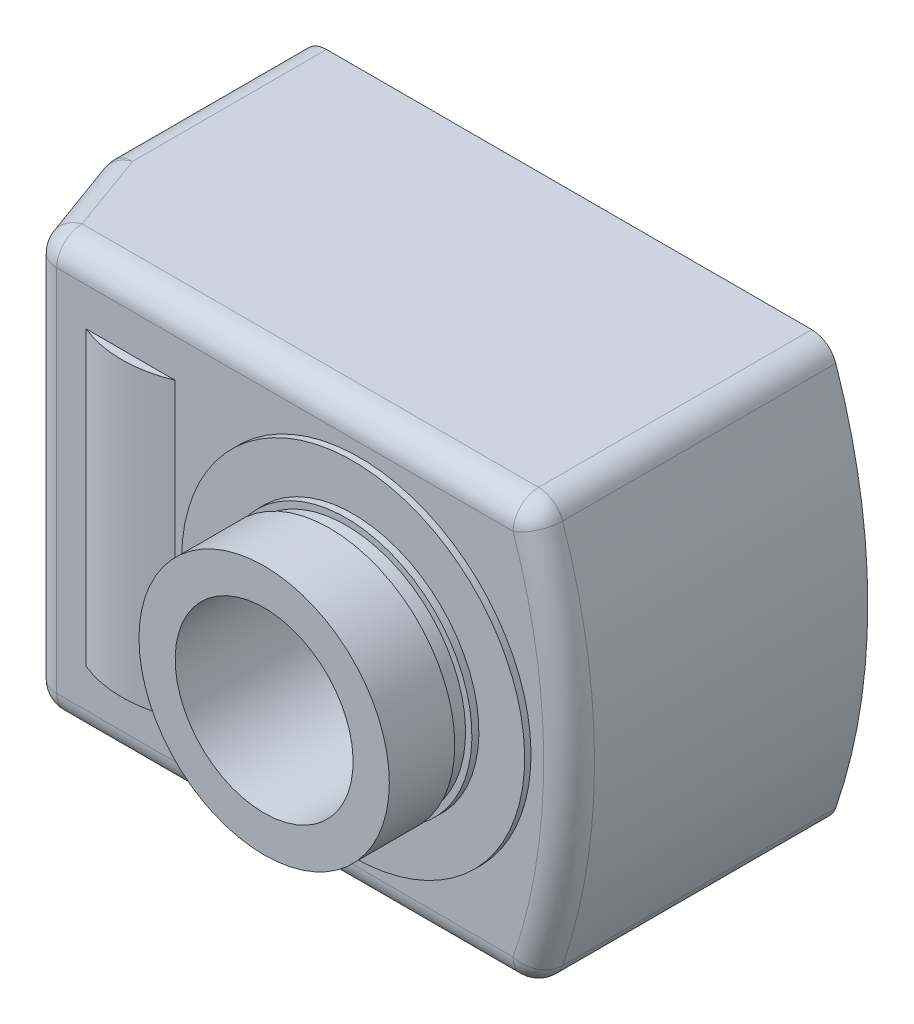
ISO-10303-21;
HEADER;
FILE_DESCRIPTION(('STEP AP214'),'2;1');
FILE_NAME('part.step','',(''),(''),'','','');
FILE_SCHEMA(('AUTOMOTIVE_DESIGN { 1 0 10303 214 1 1 1 1 }'));
ENDSEC;
DATA;
#1=APPLICATION_CONTEXT('core data for automotive mechanical design processes');
#2=APPLICATION_PROTOCOL_DEFINITION('international standard','automotive_design',2000,#1);
#3=PRODUCT_CONTEXT('',#1,'mechanical');
#4=PRODUCT('Part','Part','',(#3));
#5=PRODUCT_RELATED_PRODUCT_CATEGORY('part','',(#4));
#6=PRODUCT_DEFINITION_FORMATION('','',#4);
#7=PRODUCT_DEFINITION_CONTEXT('part definition',#1,'design');
#8=PRODUCT_DEFINITION('design','',#6,#7);
#9=PRODUCT_DEFINITION_SHAPE('','',#8);
#10=(LENGTH_UNIT() NAMED_UNIT(*) SI_UNIT(.MILLI.,.METRE.));
#11=(NAMED_UNIT(*) PLANE_ANGLE_UNIT() SI_UNIT($,.RADIAN.));
#12=(NAMED_UNIT(*) SI_UNIT($,.STERADIAN.) SOLID_ANGLE_UNIT());
#13=UNCERTAINTY_MEASURE_WITH_UNIT(LENGTH_MEASURE(1.E-05),#10,'distance_accuracy_value','');
#14=(GEOMETRIC_REPRESENTATION_CONTEXT(3) GLOBAL_UNCERTAINTY_ASSIGNED_CONTEXT((#13)) GLOBAL_UNIT_ASSIGNED_CONTEXT((#10,
#11,#12)) REPRESENTATION_CONTEXT('',''));
#15=CARTESIAN_POINT('',(0.,0.,0.));
#16=DIRECTION('',(0.,0.,1.));
#17=DIRECTION('',(1.,0.,0.));
#18=AXIS2_PLACEMENT_3D('',#15,#16,#17);
#19=CARTESIAN_POINT('',(-22.,0.,-5.));
#20=DIRECTION('',(0.,0.,1.));
#21=DIRECTION('',(1.,0.,0.));
#22=AXIS2_PLACEMENT_3D('',#19,#20,#21);
#23=CYLINDRICAL_SURFACE('',#22,3.);
#24=CARTESIAN_POINT('',(-22.,0.,0.));
#25=DIRECTION('',(0.,0.,1.));
#26=DIRECTION('',(1.,0.,0.));
#27=AXIS2_PLACEMENT_3D('',#24,#25,#26);
#28=CIRCLE('',#27,3.);
#29=CARTESIAN_POINT('',(-19.,0.,0.));
#30=VERTEX_POINT('',#29);
#31=EDGE_CURVE('E479',#30,#30,#28,.F.);
#32=ORIENTED_EDGE('',*,*,#31,.T.);
#33=EDGE_LOOP('',(#32));
#34=FACE_BOUND('',#33,.T.);
#35=CARTESIAN_POINT('',(-22.,0.,-3.));
#36=DIRECTION('',(0.,0.,-1.));
#37=DIRECTION('',(-1.,0.,0.));
#38=AXIS2_PLACEMENT_3D('',#35,#36,#37);
#39=CIRCLE('',#38,3.);
#40=CARTESIAN_POINT('',(-25.,0.,-3.));
#41=VERTEX_POINT('',#40);
#42=EDGE_CURVE('E704',#41,#41,#39,.T.);
#43=ORIENTED_EDGE('',*,*,#42,.F.);
#44=EDGE_LOOP('',(#43));
#45=FACE_BOUND('',#44,.T.);
#46=ADVANCED_FACE('F15',(#34,#45),#23,.T.);
#47=CARTESIAN_POINT('',(-26.073969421,16.499911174,15.261022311));
#48=CARTESIAN_POINT('',(-27.263075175,16.511118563,15.261022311));
#49=CARTESIAN_POINT('',(-28.103937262,15.670256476,15.261022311));
#50=CARTESIAN_POINT('',(-28.092729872,14.481150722,15.261022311));
#51=CARTESIAN_POINT('',(-26.073969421,16.499911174,15.496340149));
#52=CARTESIAN_POINT('',(-27.263075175,16.511118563,15.496340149));
#53=CARTESIAN_POINT('',(-28.103937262,15.670256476,15.496340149));
#54=CARTESIAN_POINT('',(-28.092729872,14.481150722,15.496340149));
#55=CARTESIAN_POINT('',(-26.074356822,16.458807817,15.728040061));
#56=CARTESIAN_POINT('',(-27.239023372,16.469784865,15.728040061));
#57=CARTESIAN_POINT('',(-28.062603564,15.646204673,15.728040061));
#58=CARTESIAN_POINT('',(-28.051626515,14.481538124,15.728040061));
#59=CARTESIAN_POINT('',(-26.075119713,16.377865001,15.948997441));
#60=CARTESIAN_POINT('',(-27.191659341,16.388388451,15.948997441));
#61=CARTESIAN_POINT('',(-27.981207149,15.598840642,15.948997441));
#62=CARTESIAN_POINT('',(-27.970683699,14.482301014,15.948997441));
#63=(BOUNDED_SURFACE() B_SPLINE_SURFACE(3,3,((#47,#48,#49,#50),(#51,#52,#53,#54),(#55,#56,#57,
#58),(#59,#60,#61,#62)),.UNSPECIFIED.,.F.,.F.,.F.) B_SPLINE_SURFACE_WITH_KNOTS((4,4),(4,4),(0.,
1.),(0.,1.),.UNSPECIFIED.) GEOMETRIC_REPRESENTATION_ITEM() RATIONAL_B_SPLINE_SURFACE(((1.,
0.800274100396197,0.800274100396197,1.),(0.98975024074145,0.792071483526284,0.792071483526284,
0.98975024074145),(0.98975024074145,0.792071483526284,0.792071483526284,0.98975024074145),(1.,
0.800274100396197,0.800274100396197,1.))) REPRESENTATION_ITEM('') SURFACE());
#64=CARTESIAN_POINT('',(-26.0928186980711,14.5,15.2610223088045));
#65=DIRECTION('',(0.342020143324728,0.,0.939692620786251));
#66=DIRECTION('',(0.939692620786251,0.,-0.342020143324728));
#67=AXIS2_PLACEMENT_3D('',#64,#65,#66);
#68=CIRCLE('',#67,1.99999999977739);
#69=CARTESIAN_POINT('',(-27.9722039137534,14.5000000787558,15.9450626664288));
#70=VERTEX_POINT('',#69);
#71=CARTESIAN_POINT('',(-26.0928186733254,16.4999999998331,15.2610222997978));
#72=VERTEX_POINT('',#71);
#73=EDGE_CURVE('E491',#70,#72,#68,.F.);
#74=CARTESIAN_POINT('',(-26.092818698,14.5,15.2610222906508));
#75=DIRECTION('',(0.,0.,-1.));
#76=DIRECTION('',(0.,-1.,0.));
#77=AXIS2_PLACEMENT_3D('',#74,#75,#76);
#78=CIRCLE('',#77,2.);
#79=CARTESIAN_POINT('',(-27.9855347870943,15.1462397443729,15.2610223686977));
#80=VERTEX_POINT('',#79);
#81=EDGE_CURVE('E502',#72,#80,#78,.F.);
#82=CARTESIAN_POINT('',(-27.9722039,14.500000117,15.945062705));
#83=CARTESIAN_POINT('',(-28.010529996,14.611866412,15.839762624));
#84=CARTESIAN_POINT('',(-28.03110215,14.723726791,15.728006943));
#85=CARTESIAN_POINT('',(-28.033344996,14.832452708,15.612921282));
#86=CARTESIAN_POINT('',(-28.035587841,14.941178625,15.49783562));
#87=CARTESIAN_POINT('',(-28.01950114,15.046758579,15.379432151));
#88=CARTESIAN_POINT('',(-27.985534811,15.146239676,15.261022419));
#89=B_SPLINE_CURVE_WITH_KNOTS('',3,(#82,#83,#84,#85,#86,#87,#88),.UNSPECIFIED.,.F.,.F.,(4,3,4),
(0.,0.5,1.),.UNSPECIFIED.);
#90=EDGE_CURVE('E588',#70,#80,#89,.T.);
#91=ORIENTED_EDGE('',*,*,#73,.T.);
#92=ORIENTED_EDGE('',*,*,#81,.T.);
#93=ORIENTED_EDGE('',*,*,#90,.F.);
#94=EDGE_LOOP('',(#91,#92,#93));
#95=FACE_BOUND('',#94,.T.);
#96=ADVANCED_FACE('F311',(#95),#63,.F.);
#97=CARTESIAN_POINT('',(0.,0.,31.));
#98=DIRECTION('',(0.,0.,-1.));
#99=DIRECTION('',(0.,-1.,0.));
#100=AXIS2_PLACEMENT_3D('',#97,#98,#99);
#101=CYLINDRICAL_SURFACE('',#100,7.);
#102=CARTESIAN_POINT('',(0.,0.,31.));
#103=DIRECTION('',(0.,0.,-1.));
#104=DIRECTION('',(0.,-1.,0.));
#105=AXIS2_PLACEMENT_3D('',#102,#103,#104);
#106=CIRCLE('',#105,7.);
#107=CARTESIAN_POINT('',(0.,-7.,31.));
#108=VERTEX_POINT('',#107);
#109=EDGE_CURVE('E498',#108,#108,#106,.T.);
#110=ORIENTED_EDGE('',*,*,#109,.F.);
#111=EDGE_LOOP('',(#110));
#112=FACE_BOUND('',#111,.T.);
#113=CARTESIAN_POINT('',(0.,0.,0.));
#114=DIRECTION('',(0.,0.,-1.));
#115=DIRECTION('',(0.,-1.,0.));
#116=AXIS2_PLACEMENT_3D('',#113,#114,#115);
#117=CIRCLE('',#116,7.);
#118=CARTESIAN_POINT('',(0.,-7.,0.));
#119=VERTEX_POINT('',#118);
#120=EDGE_CURVE('E475',#119,#119,#117,.T.);
#121=ORIENTED_EDGE('',*,*,#120,.T.);
#122=EDGE_LOOP('',(#121));
#123=FACE_BOUND('',#122,.T.);
#124=ADVANCED_FACE('F318',(#112,#123),#101,.F.);
#125=CARTESIAN_POINT('',(16.375,0.,15.352588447));
#126=DIRECTION('',(0.,0.,-1.));
#127=DIRECTION('',(0.,-1.,0.));
#128=AXIS2_PLACEMENT_3D('',#125,#126,#127);
#129=CYLINDRICAL_SURFACE('',#128,46.875);
#130=CARTESIAN_POINT('',(-30.5,0.,8.647346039));
#131=CARTESIAN_POINT('',(-30.5,-1.285250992,8.647346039));
#132=CARTESIAN_POINT('',(-30.447110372,-2.570501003,8.786459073));
#133=CARTESIAN_POINT('',(-30.341509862,-3.851406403,9.064214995));
#134=CARTESIAN_POINT('',(-30.235909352,-5.132311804,9.341970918));
#135=CARTESIAN_POINT('',(-30.077598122,-6.408870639,9.758369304));
#136=CARTESIAN_POINT('',(-29.867111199,-7.67676865,10.312002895));
#137=CARTESIAN_POINT('',(-29.656624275,-8.944666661,10.865636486));
#138=CARTESIAN_POINT('',(-29.393961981,-10.203901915,11.556504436));
#139=CARTESIAN_POINT('',(-29.080012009,-11.450218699,12.382271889));
#140=CARTESIAN_POINT('',(-28.766062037,-12.696535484,13.208039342));
#141=CARTESIAN_POINT('',(-28.400824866,-13.929931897,14.168705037));
#142=CARTESIAN_POINT('',(-27.985534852,-15.146239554,15.261022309));
#143=CARTESIAN_POINT('',(-27.968923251,-15.19489186,15.304715));
#144=CARTESIAN_POINT('',(-27.952311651,-15.243544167,15.348407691));
#145=CARTESIAN_POINT('',(-27.93570005,-15.292196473,15.392100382));
#146=B_SPLINE_CURVE_WITH_KNOTS('',3,(#130,#131,#132,#133,#134,#135,#136,#137,#138,#139,#140,
#141,#142,#143,#144,#145),.UNSPECIFIED.,.F.,.F.,(4,3,3,3,3,4),(0.,0.0822560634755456,
0.164512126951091,0.246768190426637,0.329024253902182,0.332314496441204),.UNSPECIFIED.);
#147=CARTESIAN_POINT('',(-30.5,-1.40302644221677E-09,8.64734603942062));
#148=VERTEX_POINT('',#147);
#149=CARTESIAN_POINT('',(-27.9855348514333,-15.1462395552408,15.2610223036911));
#150=VERTEX_POINT('',#149);
#151=EDGE_CURVE('E495',#148,#150,#146,.T.);
#152=ORIENTED_EDGE('',*,*,#151,.F.);
#153=CARTESIAN_POINT('',(-27.985534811,15.146239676,15.261022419));
#154=CARTESIAN_POINT('',(-28.400824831,13.92993201,14.168705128));
#155=CARTESIAN_POINT('',(-28.766062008,12.696535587,13.208039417));
#156=CARTESIAN_POINT('',(-29.080011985,11.450218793,12.382271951));
#157=CARTESIAN_POINT('',(-29.393961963,10.203901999,11.556504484));
#158=CARTESIAN_POINT('',(-29.656624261,8.944666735,10.865636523));
#159=CARTESIAN_POINT('',(-29.867111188,7.676768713,10.312002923));
#160=CARTESIAN_POINT('',(-30.077598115,6.408870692,9.758369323));
#161=CARTESIAN_POINT('',(-30.235909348,5.132311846,9.341970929));
#162=CARTESIAN_POINT('',(-30.34150986,3.851406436,9.064215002));
#163=CARTESIAN_POINT('',(-30.447110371,2.570501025,8.786459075));
#164=CARTESIAN_POINT('',(-30.5,1.285251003,8.647346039));
#165=CARTESIAN_POINT('',(-30.5,0.,8.647346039));
#166=B_SPLINE_CURVE_WITH_KNOTS('',3,(#153,#154,#155,#156,#157,#158,#159,#160,#161,#162,#163,
#164,#165),.UNSPECIFIED.,.F.,.F.,(4,3,3,3,4),(5.95416105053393,6.03641711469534,
6.11867317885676,6.20092924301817,6.28318530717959),.UNSPECIFIED.);
#167=EDGE_CURVE('E111',#80,#148,#166,.T.);
#168=ORIENTED_EDGE('',*,*,#167,.F.);
#169=DIRECTION('',(0.,0.,1.));
#170=VECTOR('',#169,1.);
#171=CARTESIAN_POINT('',(-27.9855347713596,15.1462397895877,7.630511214));
#172=LINE('',#171,#170);
#173=CARTESIAN_POINT('',(-27.9855348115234,15.1462396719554,0.));
#174=VERTEX_POINT('',#173);
#175=EDGE_CURVE('E585',#80,#174,#172,.F.);
#176=ORIENTED_EDGE('',*,*,#175,.T.);
#177=CARTESIAN_POINT('',(16.375,0.,0.));
#178=DIRECTION('',(0.,0.,-1.));
#179=DIRECTION('',(0.,-1.,0.));
#180=AXIS2_PLACEMENT_3D('',#177,#178,#179);
#181=CIRCLE('',#180,46.875);
#182=CARTESIAN_POINT('',(-27.9855348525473,-15.1462395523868,0.));
#183=VERTEX_POINT('',#182);
#184=EDGE_CURVE('E103',#174,#183,#181,.F.);
#185=ORIENTED_EDGE('',*,*,#184,.T.);
#186=DIRECTION('',(0.,0.,-1.));
#187=VECTOR('',#186,1.);
#188=CARTESIAN_POINT('',(-27.9855348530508,-15.146239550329,7.630511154));
#189=LINE('',#188,#187);
#190=EDGE_CURVE('E468',#183,#150,#189,.F.);
#191=ORIENTED_EDGE('',*,*,#190,.T.);
#192=EDGE_LOOP('',(#152,#168,#176,#185,#191));
#193=FACE_BOUND('',#192,.T.);
#194=ADVANCED_FACE('F508',(#193),#129,.T.);
#195=CARTESIAN_POINT('',(-28.092729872,-14.481150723,15.26102229));
#196=CARTESIAN_POINT('',(-28.103937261,-15.670256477,15.26102229));
#197=CARTESIAN_POINT('',(-27.263075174,-16.511118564,15.26102229));
#198=CARTESIAN_POINT('',(-26.073969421,-16.499911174,15.26102229));
#199=CARTESIAN_POINT('',(-28.092729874,-14.481150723,15.496340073));
#200=CARTESIAN_POINT('',(-28.103937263,-15.670256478,15.496340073));
#201=CARTESIAN_POINT('',(-27.263075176,-16.511118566,15.496340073));
#202=CARTESIAN_POINT('',(-26.073969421,-16.499911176,15.496340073));
#203=CARTESIAN_POINT('',(-28.051626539,-14.481538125,15.728039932));
#204=CARTESIAN_POINT('',(-28.062603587,-15.646204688,15.728039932));
#205=CARTESIAN_POINT('',(-27.239023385,-16.46978489,15.728039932));
#206=CARTESIAN_POINT('',(-26.074356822,-16.458807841,15.728039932));
#207=CARTESIAN_POINT('',(-27.970683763,-14.482301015,15.948997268));
#208=CARTESIAN_POINT('',(-27.981207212,-15.59884068,15.948997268));
#209=CARTESIAN_POINT('',(-27.191659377,-16.388388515,15.948997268));
#210=CARTESIAN_POINT('',(-26.075119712,-16.377865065,15.948997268));
#211=(BOUNDED_SURFACE() B_SPLINE_SURFACE(3,3,((#195,#196,#197,#198),(#199,#200,#201,#202),(#203,
#204,#205,#206),(#207,#208,#209,#210)),.UNSPECIFIED.,.F.,.F.,
.F.) B_SPLINE_SURFACE_WITH_KNOTS((4,4),(4,4),(0.,1.),(0.,1.),
.UNSPECIFIED.) GEOMETRIC_REPRESENTATION_ITEM() RATIONAL_B_SPLINE_SURFACE(((1.,0.800274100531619,
0.800274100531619,1.),(0.989750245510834,0.792071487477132,0.792071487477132,0.989750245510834),
(0.989750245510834,0.792071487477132,0.792071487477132,0.989750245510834),(1.,0.800274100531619,
0.800274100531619,1.))) REPRESENTATION_ITEM('') SURFACE());
#212=CARTESIAN_POINT('',(-27.9855348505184,-15.1462395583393,15.2610223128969));
#213=CARTESIAN_POINT('',(-28.0195011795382,-15.046758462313,15.3794320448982));
#214=CARTESIAN_POINT('',(-28.0355878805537,-14.9411785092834,15.4978355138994));
#215=CARTESIAN_POINT('',(-28.0333450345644,-14.832452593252,15.6129211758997));
#216=CARTESIAN_POINT('',(-28.031102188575,-14.7237266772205,15.7280068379));
#217=CARTESIAN_POINT('',(-28.0105300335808,-14.6118662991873,15.8397625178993));
#218=CARTESIAN_POINT('',(-27.9722039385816,-14.5000000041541,15.9450625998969));
#219=B_SPLINE_CURVE_WITH_KNOTS('',3,(#212,#213,#214,#215,#216,#217,#218),.UNSPECIFIED.,.F.,.F.,
(4,3,4),(0.,0.5,1.),.UNSPECIFIED.);
#220=CARTESIAN_POINT('',(-27.9722039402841,-14.5000000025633,15.9450625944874));
#221=VERTEX_POINT('',#220);
#222=EDGE_CURVE('E538',#150,#221,#219,.T.);
#223=CARTESIAN_POINT('',(-26.092818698,-14.5,15.261022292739));
#224=DIRECTION('',(0.,0.,-1.));
#225=DIRECTION('',(0.,-1.,0.));
#226=AXIS2_PLACEMENT_3D('',#223,#224,#225);
#227=CIRCLE('',#226,2.);
#228=CARTESIAN_POINT('',(-26.0928186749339,-16.500000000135,15.2610223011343));
#229=VERTEX_POINT('',#228);
#230=EDGE_CURVE('E474',#150,#229,#227,.F.);
#231=CARTESIAN_POINT('',(-26.0928186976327,-14.5,15.2610223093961));
#232=DIRECTION('',(-0.342020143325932,0.,-0.939692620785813));
#233=DIRECTION('',(-0.939692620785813,0.,0.342020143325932));
#234=AXIS2_PLACEMENT_3D('',#231,#232,#233);
#235=CIRCLE('',#234,2.00000000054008);
#236=EDGE_CURVE('E465',#229,#221,#235,.T.);
#237=ORIENTED_EDGE('',*,*,#222,.F.);
#238=ORIENTED_EDGE('',*,*,#230,.T.);
#239=ORIENTED_EDGE('',*,*,#236,.T.);
#240=EDGE_LOOP('',(#237,#238,#239));
#241=FACE_BOUND('',#240,.T.);
#242=ADVANCED_FACE('F346',(#241),#211,.F.);
#243=CARTESIAN_POINT('',(10.0188,-10.0188,31.));
#244=DIRECTION('',(0.,0.,1.));
#245=DIRECTION('',(0.,1.,0.));
#246=AXIS2_PLACEMENT_3D('',#243,#244,#245);
#247=PLANE('',#246);
#248=CARTESIAN_POINT('',(0.,0.,31.));
#249=DIRECTION('',(0.,0.,-1.));
#250=DIRECTION('',(0.,-1.,0.));
#251=AXIS2_PLACEMENT_3D('',#248,#249,#250);
#252=CIRCLE('',#251,9.85);
#253=CARTESIAN_POINT('',(0.,-9.85,31.));
#254=VERTEX_POINT('',#253);
#255=EDGE_CURVE('E706',#254,#254,#252,.T.);
#256=ORIENTED_EDGE('',*,*,#255,.F.);
#257=EDGE_LOOP('',(#256));
#258=FACE_BOUND('',#257,.T.);
#259=ORIENTED_EDGE('',*,*,#109,.T.);
#260=EDGE_LOOP('',(#259));
#261=FACE_BOUND('',#260,.T.);
#262=ADVANCED_FACE('F342',(#258,#261),#247,.T.);
#263=CARTESIAN_POINT('',(-26.092818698,14.5,15.261022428));
#264=DIRECTION('',(0.,0.,-1.));
#265=DIRECTION('',(-1.,0.,0.));
#266=AXIS2_PLACEMENT_3D('',#263,#264,#265);
#267=CYLINDRICAL_SURFACE('',#266,2.);
#268=CARTESIAN_POINT('',(-26.092818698,14.5,0.));
#269=DIRECTION('',(0.,0.,-1.));
#270=DIRECTION('',(-1.,0.,0.));
#271=AXIS2_PLACEMENT_3D('',#268,#269,#270);
#272=CIRCLE('',#271,2.);
#273=CARTESIAN_POINT('',(-26.092818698,16.5,0.));
#274=VERTEX_POINT('',#273);
#275=EDGE_CURVE('E487',#274,#174,#272,.F.);
#276=ORIENTED_EDGE('',*,*,#275,.T.);
#277=ORIENTED_EDGE('',*,*,#175,.F.);
#278=ORIENTED_EDGE('',*,*,#81,.F.);
#279=DIRECTION('',(0.,0.,-1.));
#280=VECTOR('',#279,1.);
#281=CARTESIAN_POINT('',(-26.092818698,16.5,10.75));
#282=LINE('',#281,#280);
#283=EDGE_CURVE('E460',#72,#274,#282,.T.);
#284=ORIENTED_EDGE('',*,*,#283,.T.);
#285=EDGE_LOOP('',(#276,#277,#278,#284));
#286=FACE_BOUND('',#285,.T.);
#287=ADVANCED_FACE('F345',(#286),#267,.T.);
#288=CARTESIAN_POINT('',(12.092818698,14.5,21.5));
#289=DIRECTION('',(0.,0.,-1.));
#290=DIRECTION('',(-1.,0.,0.));
#291=AXIS2_PLACEMENT_3D('',#288,#289,#290);
#292=CYLINDRICAL_SURFACE('',#291,2.);
#293=CARTESIAN_POINT('',(12.092818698,14.5,0.));
#294=DIRECTION('',(0.,0.,-1.));
#295=DIRECTION('',(-1.,0.,0.));
#296=AXIS2_PLACEMENT_3D('',#293,#294,#295);
#297=CIRCLE('',#296,2.);
#298=CARTESIAN_POINT('',(13.985534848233,15.1462395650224,0.));
#299=VERTEX_POINT('',#298);
#300=CARTESIAN_POINT('',(12.092818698,16.5,0.));
#301=VERTEX_POINT('',#300);
#302=EDGE_CURVE('E482',#299,#301,#297,.F.);
#303=ORIENTED_EDGE('',*,*,#302,.T.);
#304=DIRECTION('',(0.,0.,1.));
#305=VECTOR('',#304,1.);
#306=CARTESIAN_POINT('',(12.092818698,16.5,10.75));
#307=LINE('',#306,#305);
#308=CARTESIAN_POINT('',(12.0928187,16.5,21.5000000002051));
#309=VERTEX_POINT('',#308);
#310=EDGE_CURVE('E455',#301,#309,#307,.T.);
#311=ORIENTED_EDGE('',*,*,#310,.T.);
#312=CARTESIAN_POINT('',(12.092818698,14.5,21.5));
#313=DIRECTION('',(0.,0.,-1.));
#314=DIRECTION('',(-1.,0.,0.));
#315=AXIS2_PLACEMENT_3D('',#312,#313,#314);
#316=CIRCLE('',#315,2.);
#317=CARTESIAN_POINT('',(13.9855348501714,15.1462395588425,21.5));
#318=VERTEX_POINT('',#317);
#319=EDGE_CURVE('E445',#309,#318,#316,.T.);
#320=ORIENTED_EDGE('',*,*,#319,.T.);
#321=DIRECTION('',(0.,0.,1.));
#322=VECTOR('',#321,1.);
#323=CARTESIAN_POINT('',(13.9855348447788,15.1462395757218,10.75));
#324=LINE('',#323,#322);
#325=EDGE_CURVE('E260',#318,#299,#324,.F.);
#326=ORIENTED_EDGE('',*,*,#325,.T.);
#327=EDGE_LOOP('',(#303,#311,#320,#326));
#328=FACE_BOUND('',#327,.T.);
#329=ADVANCED_FACE('F890',(#328),#292,.T.);
#330=CARTESIAN_POINT('',(-27.985534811,15.146239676,15.261022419));
#331=CARTESIAN_POINT('',(-28.01950114,15.046758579,15.379432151));
#332=CARTESIAN_POINT('',(-28.035587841,14.941178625,15.49783562));
#333=CARTESIAN_POINT('',(-28.033344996,14.832452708,15.612921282));
#334=CARTESIAN_POINT('',(-28.03110215,14.723726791,15.728006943));
#335=CARTESIAN_POINT('',(-28.010529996,14.611866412,15.839762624));
#336=CARTESIAN_POINT('',(-27.9722039,14.500000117,15.945062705));
#337=CARTESIAN_POINT('',(-28.400824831,13.92993201,14.168705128));
#338=CARTESIAN_POINT('',(-28.429236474,13.837799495,14.286768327));
#339=CARTESIAN_POINT('',(-28.440978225,13.740527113,14.40482624));
#340=CARTESIAN_POINT('',(-28.435755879,13.640610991,14.519828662));
#341=CARTESIAN_POINT('',(-28.430533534,13.540694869,14.634831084));
#342=CARTESIAN_POINT('',(-28.408347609,13.438143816,14.746767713));
#343=CARTESIAN_POINT('',(-28.36977488,13.335588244,14.852745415));
#344=CARTESIAN_POINT('',(-28.766062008,12.696535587,13.208039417));
#345=CARTESIAN_POINT('',(-28.789561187,12.612100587,13.325801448));
#346=CARTESIAN_POINT('',(-28.797484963,12.523319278,13.443558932));
#347=CARTESIAN_POINT('',(-28.789648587,12.432306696,13.558488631));
#348=CARTESIAN_POINT('',(-28.78181221,12.341294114,13.67341833));
#349=CARTESIAN_POINT('',(-28.758216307,12.248057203,13.785511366));
#350=CARTESIAN_POINT('',(-28.719428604,12.154816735,13.892079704));
#351=CARTESIAN_POINT('',(-29.080011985,11.450218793,12.382271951));
#352=CARTESIAN_POINT('',(-29.099275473,11.37374671,12.499776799));
#353=CARTESIAN_POINT('',(-29.103919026,11.29359458,12.617277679));
#354=CARTESIAN_POINT('',(-29.093838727,11.211556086,12.732145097));
#355=CARTESIAN_POINT('',(-29.083758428,11.129517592,12.847012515));
#356=CARTESIAN_POINT('',(-29.058954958,11.045598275,12.959238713));
#357=CARTESIAN_POINT('',(-29.019983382,10.961676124,13.066312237));
#358=CARTESIAN_POINT('',(-29.393961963,10.203901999,11.556504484));
#359=CARTESIAN_POINT('',(-29.40898976,10.135392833,11.673752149));
#360=CARTESIAN_POINT('',(-29.410353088,10.063869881,11.790996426));
#361=CARTESIAN_POINT('',(-29.398028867,9.990805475,11.905801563));
#362=CARTESIAN_POINT('',(-29.385704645,9.917741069,12.0206067));
#363=CARTESIAN_POINT('',(-29.359693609,9.843139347,12.13296606));
#364=CARTESIAN_POINT('',(-29.320538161,9.768535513,12.240544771));
#365=CARTESIAN_POINT('',(-29.656624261,8.944666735,10.865636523));
#366=CARTESIAN_POINT('',(-29.668093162,8.884385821,10.982670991));
#367=CARTESIAN_POINT('',(-29.666714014,8.821630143,11.09970249));
#368=CARTESIAN_POINT('',(-29.65251598,8.757610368,11.214455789));
#369=CARTESIAN_POINT('',(-29.638317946,8.693590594,11.329209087));
#370=CARTESIAN_POINT('',(-29.611301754,8.628309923,11.441678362));
#371=CARTESIAN_POINT('',(-29.571993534,8.563027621,11.549676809));
#372=CARTESIAN_POINT('',(-29.867111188,7.676768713,10.312002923));
#373=CARTESIAN_POINT('',(-29.875722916,7.62489474,10.428867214));
#374=CARTESIAN_POINT('',(-29.872146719,7.57099863,10.545728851));
#375=CARTESIAN_POINT('',(-29.856448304,7.516070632,10.6604407));
#376=CARTESIAN_POINT('',(-29.840749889,7.461142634,10.775152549));
#377=CARTESIAN_POINT('',(-29.812929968,7.405185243,10.887709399));
#378=CARTESIAN_POINT('',(-29.773499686,7.349226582,10.996043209));
#379=CARTESIAN_POINT('',(-30.077598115,6.408870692,9.758369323));
#380=CARTESIAN_POINT('',(-30.08335267,6.36540366,9.875063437));
#381=CARTESIAN_POINT('',(-30.077579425,6.320367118,9.991755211));
#382=CARTESIAN_POINT('',(-30.060380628,6.274530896,10.106425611));
#383=CARTESIAN_POINT('',(-30.043181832,6.228694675,10.22109601));
#384=CARTESIAN_POINT('',(-30.014558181,6.182060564,10.333740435));
#385=CARTESIAN_POINT('',(-29.975005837,6.135425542,10.442409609));
#386=CARTESIAN_POINT('',(-30.235909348,5.132311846,9.341970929));
#387=CARTESIAN_POINT('',(-30.239508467,5.097430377,9.458537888));
#388=CARTESIAN_POINT('',(-30.232083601,5.061345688,9.575102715));
#389=CARTESIAN_POINT('',(-30.213757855,5.024648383,9.689742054));
#390=CARTESIAN_POINT('',(-30.195432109,4.987951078,9.804381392));
#391=CARTESIAN_POINT('',(-30.166206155,4.950642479,9.917091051));
#392=CARTESIAN_POINT('',(-30.126562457,4.913333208,10.026011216));
#393=CARTESIAN_POINT('',(-30.34150986,3.851406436,9.064215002));
#394=CARTESIAN_POINT('',(-30.343670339,3.825200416,9.180697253));
#395=CARTESIAN_POINT('',(-30.335143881,3.798113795,9.297177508));
#396=CARTESIAN_POINT('',(-30.316066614,3.770579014,9.411796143));
#397=CARTESIAN_POINT('',(-30.296989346,3.743044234,9.526414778));
#398=CARTESIAN_POINT('',(-30.267361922,3.715062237,9.639167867));
#399=CARTESIAN_POINT('',(-30.227657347,3.687079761,9.748255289));
#400=CARTESIAN_POINT('',(-30.447110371,2.570501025,8.786459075));
#401=CARTESIAN_POINT('',(-30.44783221,2.552970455,8.902856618));
#402=CARTESIAN_POINT('',(-30.438204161,2.534881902,9.019252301));
#403=CARTESIAN_POINT('',(-30.418375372,2.516509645,9.133850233));
#404=CARTESIAN_POINT('',(-30.398546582,2.498137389,9.248448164));
#405=CARTESIAN_POINT('',(-30.368517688,2.479481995,9.361244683));
#406=CARTESIAN_POINT('',(-30.328752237,2.460826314,9.470499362));
#407=CARTESIAN_POINT('',(-30.5,1.285251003,8.647346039));
#408=CARTESIAN_POINT('',(-30.5,1.2764857,8.763701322));
#409=CARTESIAN_POINT('',(-30.489820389,1.267441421,8.880054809));
#410=CARTESIAN_POINT('',(-30.469615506,1.258255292,8.994642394));
#411=CARTESIAN_POINT('',(-30.449410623,1.249069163,9.109229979));
#412=CARTESIAN_POINT('',(-30.419181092,1.239741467,9.222048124));
#413=CARTESIAN_POINT('',(-30.379385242,1.230413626,9.331386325));
#414=CARTESIAN_POINT('',(-30.5,0.,8.647346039));
#415=CARTESIAN_POINT('',(-30.5,0.,8.763701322));
#416=CARTESIAN_POINT('',(-30.489820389,0.,8.880054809));
#417=CARTESIAN_POINT('',(-30.469615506,0.,8.994642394));
#418=CARTESIAN_POINT('',(-30.449410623,0.,9.109229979));
#419=CARTESIAN_POINT('',(-30.419181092,0.,9.222048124));
#420=CARTESIAN_POINT('',(-30.379385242,0.,9.331386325));
#421=B_SPLINE_SURFACE_WITH_KNOTS('',3,3,((#330,#331,#332,#333,#334,#335,#336),(#337,#338,#339,
#340,#341,#342,#343),(#344,#345,#346,#347,#348,#349,#350),(#351,#352,#353,#354,#355,#356,#357),
(#358,#359,#360,#361,#362,#363,#364),(#365,#366,#367,#368,#369,#370,#371),(#372,#373,#374,#375,
#376,#377,#378),(#379,#380,#381,#382,#383,#384,#385),(#386,#387,#388,#389,#390,#391,#392),(#393,
#394,#395,#396,#397,#398,#399),(#400,#401,#402,#403,#404,#405,#406),(#407,#408,#409,#410,#411,
#412,#413),(#414,#415,#416,#417,#418,#419,#420)),.UNSPECIFIED.,.F.,.F.,.F.,(4,3,3,3,4),(4,3,4),
(5.95416105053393,6.03641711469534,6.11867317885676,6.20092924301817,6.28318530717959),(0.,0.5,
1.),.UNSPECIFIED.);
#422=CARTESIAN_POINT('',(-30.5,0.,8.647346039));
#423=CARTESIAN_POINT('',(-30.5,0.,8.763701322));
#424=CARTESIAN_POINT('',(-30.489820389,0.,8.880054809));
#425=CARTESIAN_POINT('',(-30.469615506,0.,8.994642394));
#426=CARTESIAN_POINT('',(-30.449410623,0.,9.109229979));
#427=CARTESIAN_POINT('',(-30.419181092,0.,9.222048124));
#428=CARTESIAN_POINT('',(-30.379385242,0.,9.331386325));
#429=B_SPLINE_CURVE_WITH_KNOTS('',3,(#422,#423,#424,#425,#426,#427,#428),.UNSPECIFIED.,.F.,.F.,
(4,3,4),(0.,0.5,1.),.UNSPECIFIED.);
#430=CARTESIAN_POINT('',(-30.3793852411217,-5.99999563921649E-10,9.33138632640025));
#431=VERTEX_POINT('',#430);
#432=EDGE_CURVE('E620',#431,#148,#429,.F.);
#433=CARTESIAN_POINT('',(-30.379385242,0.,9.331386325));
#434=CARTESIAN_POINT('',(-30.379385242,1.230413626,9.331386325));
#435=CARTESIAN_POINT('',(-30.328752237,2.460826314,9.470499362));
#436=CARTESIAN_POINT('',(-30.227657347,3.687079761,9.748255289));
#437=CARTESIAN_POINT('',(-30.126562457,4.913333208,10.026011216));
#438=CARTESIAN_POINT('',(-29.975005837,6.135425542,10.442409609));
#439=CARTESIAN_POINT('',(-29.773499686,7.349226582,10.996043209));
#440=CARTESIAN_POINT('',(-29.571993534,8.563027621,11.549676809));
#441=CARTESIAN_POINT('',(-29.320538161,9.768535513,12.240544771));
#442=CARTESIAN_POINT('',(-29.019983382,10.961676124,13.066312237));
#443=CARTESIAN_POINT('',(-28.719428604,12.154816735,13.892079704));
#444=CARTESIAN_POINT('',(-28.36977488,13.335588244,14.852745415));
#445=CARTESIAN_POINT('',(-27.9722039,14.500000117,15.945062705));
#446=B_SPLINE_CURVE_WITH_KNOTS('',3,(#433,#434,#435,#436,#437,#438,#439,#440,#441,#442,#443,
#444,#445),.UNSPECIFIED.,.F.,.F.,(4,3,3,3,4),(5.95416105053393,6.03641711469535,
6.11867317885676,6.20092924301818,6.28318530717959),.UNSPECIFIED.);
#447=EDGE_CURVE('E615',#70,#431,#446,.F.);
#448=ORIENTED_EDGE('',*,*,#167,.T.);
#449=ORIENTED_EDGE('',*,*,#432,.F.);
#450=ORIENTED_EDGE('',*,*,#447,.F.);
#451=ORIENTED_EDGE('',*,*,#90,.T.);
#452=EDGE_LOOP('',(#448,#449,#450,#451));
#453=FACE_BOUND('',#452,.T.);
#454=ADVANCED_FACE('F555',(#453),#421,.T.);
#455=CARTESIAN_POINT('',(-30.5,0.,8.647346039));
#456=CARTESIAN_POINT('',(-30.5,0.,8.763701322));
#457=CARTESIAN_POINT('',(-30.489820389,0.,8.880054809));
#458=CARTESIAN_POINT('',(-30.469615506,0.,8.994642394));
#459=CARTESIAN_POINT('',(-30.449410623,0.,9.109229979));
#460=CARTESIAN_POINT('',(-30.419181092,0.,9.222048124));
#461=CARTESIAN_POINT('',(-30.379385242,0.,9.331386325));
#462=CARTESIAN_POINT('',(-30.5,-1.285250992,8.647346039));
#463=CARTESIAN_POINT('',(-30.5,-1.276485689,8.763701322));
#464=CARTESIAN_POINT('',(-30.489820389,-1.267441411,8.880054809));
#465=CARTESIAN_POINT('',(-30.469615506,-1.258255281,8.994642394));
#466=CARTESIAN_POINT('',(-30.449410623,-1.249069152,9.109229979));
#467=CARTESIAN_POINT('',(-30.419181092,-1.239741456,9.222048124));
#468=CARTESIAN_POINT('',(-30.379385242,-1.230413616,9.331386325));
#469=CARTESIAN_POINT('',(-30.447110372,-2.570501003,8.786459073));
#470=CARTESIAN_POINT('',(-30.447832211,-2.552970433,8.902856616));
#471=CARTESIAN_POINT('',(-30.438204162,-2.53488188,9.019252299));
#472=CARTESIAN_POINT('',(-30.418375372,-2.516509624,9.13385023));
#473=CARTESIAN_POINT('',(-30.398546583,-2.498137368,9.248448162));
#474=CARTESIAN_POINT('',(-30.368517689,-2.479481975,9.361244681));
#475=CARTESIAN_POINT('',(-30.328752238,-2.460826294,9.47049936));
#476=CARTESIAN_POINT('',(-30.341509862,-3.851406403,9.064214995));
#477=CARTESIAN_POINT('',(-30.343670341,-3.825200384,9.180697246));
#478=CARTESIAN_POINT('',(-30.335143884,-3.798113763,9.297177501));
#479=CARTESIAN_POINT('',(-30.316066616,-3.770578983,9.411796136));
#480=CARTESIAN_POINT('',(-30.296989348,-3.743044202,9.526414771));
#481=CARTESIAN_POINT('',(-30.267361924,-3.715062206,9.63916786));
#482=CARTESIAN_POINT('',(-30.22765735,-3.68707973,9.748255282));
#483=CARTESIAN_POINT('',(-30.235909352,-5.132311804,9.341970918));
#484=CARTESIAN_POINT('',(-30.239508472,-5.097430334,9.458537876));
#485=CARTESIAN_POINT('',(-30.232083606,-5.061345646,9.575102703));
#486=CARTESIAN_POINT('',(-30.21375786,-5.024648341,9.689742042));
#487=CARTESIAN_POINT('',(-30.195432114,-4.987951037,9.804381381));
#488=CARTESIAN_POINT('',(-30.16620616,-4.950642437,9.917091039));
#489=CARTESIAN_POINT('',(-30.126562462,-4.913333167,10.026011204));
#490=CARTESIAN_POINT('',(-30.077598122,-6.408870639,9.758369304));
#491=CARTESIAN_POINT('',(-30.083352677,-6.365403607,9.875063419));
#492=CARTESIAN_POINT('',(-30.077579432,-6.320367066,9.991755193));
#493=CARTESIAN_POINT('',(-30.060380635,-6.274530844,10.106425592));
#494=CARTESIAN_POINT('',(-30.043181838,-6.228694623,10.221095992));
#495=CARTESIAN_POINT('',(-30.014558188,-6.182060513,10.333740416));
#496=CARTESIAN_POINT('',(-29.975005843,-6.135425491,10.442409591));
#497=CARTESIAN_POINT('',(-29.867111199,-7.67676865,10.312002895));
#498=CARTESIAN_POINT('',(-29.875722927,-7.624894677,10.428867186));
#499=CARTESIAN_POINT('',(-29.87214673,-7.570998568,10.545728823));
#500=CARTESIAN_POINT('',(-29.856448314,-7.51607057,10.660440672));
#501=CARTESIAN_POINT('',(-29.840749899,-7.461142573,10.775152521));
#502=CARTESIAN_POINT('',(-29.812929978,-7.405185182,10.887709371));
#503=CARTESIAN_POINT('',(-29.773499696,-7.349226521,10.996043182));
#504=CARTESIAN_POINT('',(-29.656624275,-8.944666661,10.865636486));
#505=CARTESIAN_POINT('',(-29.668093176,-8.884385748,10.982670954));
#506=CARTESIAN_POINT('',(-29.666714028,-8.82163007,11.099702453));
#507=CARTESIAN_POINT('',(-29.652515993,-8.757610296,11.214455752));
#508=CARTESIAN_POINT('',(-29.638317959,-8.693590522,11.32920905));
#509=CARTESIAN_POINT('',(-29.611301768,-8.628309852,11.441678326));
#510=CARTESIAN_POINT('',(-29.571993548,-8.56302755,11.549676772));
#511=CARTESIAN_POINT('',(-29.393961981,-10.203901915,11.556504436));
#512=CARTESIAN_POINT('',(-29.408989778,-10.13539275,11.673752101));
#513=CARTESIAN_POINT('',(-29.410353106,-10.063869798,11.790996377));
#514=CARTESIAN_POINT('',(-29.398028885,-9.990805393,11.905801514));
#515=CARTESIAN_POINT('',(-29.385704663,-9.917740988,12.020606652));
#516=CARTESIAN_POINT('',(-29.359693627,-9.843139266,12.132966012));
#517=CARTESIAN_POINT('',(-29.320538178,-9.768535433,12.240544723));
#518=CARTESIAN_POINT('',(-29.080012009,-11.450218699,12.382271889));
#519=CARTESIAN_POINT('',(-29.099275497,-11.373746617,12.499776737));
#520=CARTESIAN_POINT('',(-29.103919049,-11.293594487,12.617277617));
#521=CARTESIAN_POINT('',(-29.09383875,-11.211555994,12.732145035));
#522=CARTESIAN_POINT('',(-29.08375845,-11.129517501,12.847012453));
#523=CARTESIAN_POINT('',(-29.058954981,-11.045598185,12.959238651));
#524=CARTESIAN_POINT('',(-29.019983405,-10.961676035,13.066312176));
#525=CARTESIAN_POINT('',(-28.766062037,-12.696535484,13.208039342));
#526=CARTESIAN_POINT('',(-28.789561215,-12.612100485,13.325801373));
#527=CARTESIAN_POINT('',(-28.797484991,-12.523319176,13.443558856));
#528=CARTESIAN_POINT('',(-28.789648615,-12.432306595,13.558488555));
#529=CARTESIAN_POINT('',(-28.781812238,-12.341294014,13.673418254));
#530=CARTESIAN_POINT('',(-28.758216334,-12.248057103,13.785511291));
#531=CARTESIAN_POINT('',(-28.719428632,-12.154816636,13.892079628));
#532=CARTESIAN_POINT('',(-28.400824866,-13.929931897,14.168705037));
#533=CARTESIAN_POINT('',(-28.429236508,-13.837799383,14.286768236));
#534=CARTESIAN_POINT('',(-28.440978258,-13.740527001,14.404826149));
#535=CARTESIAN_POINT('',(-28.435755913,-13.64061088,14.519828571));
#536=CARTESIAN_POINT('',(-28.430533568,-13.540694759,14.634830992));
#537=CARTESIAN_POINT('',(-28.408347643,-13.438143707,14.746767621));
#538=CARTESIAN_POINT('',(-28.369774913,-13.335588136,14.852745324));
#539=CARTESIAN_POINT('',(-27.985534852,-15.146239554,15.261022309));
#540=CARTESIAN_POINT('',(-28.019501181,-15.046758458,15.379432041));
#541=CARTESIAN_POINT('',(-28.035587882,-14.941178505,15.49783551));
#542=CARTESIAN_POINT('',(-28.033345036,-14.832452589,15.612921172));
#543=CARTESIAN_POINT('',(-28.03110219,-14.723726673,15.728006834));
#544=CARTESIAN_POINT('',(-28.010530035,-14.611866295,15.839762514));
#545=CARTESIAN_POINT('',(-27.97220394,-14.5,15.945062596));
#546=CARTESIAN_POINT('',(-27.968923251,-15.19489186,15.304715));
#547=CARTESIAN_POINT('',(-28.003111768,-15.095116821,15.423138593));
#548=CARTESIAN_POINT('',(-28.019372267,-14.989204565,15.541555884));
#549=CARTESIAN_POINT('',(-28.017248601,-14.880126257,15.656644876));
#550=CARTESIAN_POINT('',(-28.015124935,-14.77104795,15.771733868));
#551=CARTESIAN_POINT('',(-27.994617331,-14.658815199,15.88348231));
#552=CARTESIAN_POINT('',(-27.956301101,-14.546576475,15.988755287));
#553=CARTESIAN_POINT('',(-27.952311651,-15.243544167,15.348407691));
#554=CARTESIAN_POINT('',(-27.986722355,-15.143475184,15.466845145));
#555=CARTESIAN_POINT('',(-28.003156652,-15.037230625,15.585276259));
#556=CARTESIAN_POINT('',(-28.001152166,-14.927799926,15.70036858));
#557=CARTESIAN_POINT('',(-27.99914768,-14.818369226,15.815460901));
#558=CARTESIAN_POINT('',(-27.978704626,-14.705764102,15.927202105));
#559=CARTESIAN_POINT('',(-27.940398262,-14.593152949,16.032447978));
#560=CARTESIAN_POINT('',(-27.93570005,-15.292196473,15.392100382));
#561=CARTESIAN_POINT('',(-27.970332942,-15.191833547,15.510551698));
#562=CARTESIAN_POINT('',(-27.986941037,-15.085256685,15.628996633));
#563=CARTESIAN_POINT('',(-27.985055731,-14.975473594,15.744092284));
#564=CARTESIAN_POINT('',(-27.983170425,-14.865690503,15.859187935));
#565=CARTESIAN_POINT('',(-27.962791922,-14.752713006,15.970921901));
#566=CARTESIAN_POINT('',(-27.924495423,-14.639729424,16.076140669));
#567=B_SPLINE_SURFACE_WITH_KNOTS('',3,3,((#455,#456,#457,#458,#459,#460,#461),(#462,#463,#464,
#465,#466,#467,#468),(#469,#470,#471,#472,#473,#474,#475),(#476,#477,#478,#479,#480,#481,#482),
(#483,#484,#485,#486,#487,#488,#489),(#490,#491,#492,#493,#494,#495,#496),(#497,#498,#499,#500,
#501,#502,#503),(#504,#505,#506,#507,#508,#509,#510),(#511,#512,#513,#514,#515,#516,#517),(#518,
#519,#520,#521,#522,#523,#524),(#525,#526,#527,#528,#529,#530,#531),(#532,#533,#534,#535,#536,
#537,#538),(#539,#540,#541,#542,#543,#544,#545),(#546,#547,#548,#549,#550,#551,#552),(#553,#554,
#555,#556,#557,#558,#559),(#560,#561,#562,#563,#564,#565,#566)),.UNSPECIFIED.,.F.,.F.,.F.,(4,3,
3,3,3,4),(4,3,4),(0.,0.0822560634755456,0.164512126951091,0.246768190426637,0.329024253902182,
0.332314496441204),(0.,0.5,1.),.UNSPECIFIED.);
#568=CARTESIAN_POINT('',(-27.924495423,-14.639729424,16.076140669));
#569=CARTESIAN_POINT('',(-27.940398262,-14.593152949,16.032447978));
#570=CARTESIAN_POINT('',(-27.956301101,-14.546576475,15.988755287));
#571=CARTESIAN_POINT('',(-27.97220394,-14.5,15.945062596));
#572=CARTESIAN_POINT('',(-28.369774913,-13.335588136,14.852745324));
#573=CARTESIAN_POINT('',(-28.719428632,-12.154816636,13.892079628));
#574=CARTESIAN_POINT('',(-29.019983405,-10.961676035,13.066312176));
#575=CARTESIAN_POINT('',(-29.320538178,-9.768535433,12.240544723));
#576=CARTESIAN_POINT('',(-29.571993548,-8.56302755,11.549676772));
#577=CARTESIAN_POINT('',(-29.773499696,-7.349226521,10.996043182));
#578=CARTESIAN_POINT('',(-29.975005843,-6.135425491,10.442409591));
#579=CARTESIAN_POINT('',(-30.126562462,-4.913333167,10.026011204));
#580=CARTESIAN_POINT('',(-30.22765735,-3.68707973,9.748255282));
#581=CARTESIAN_POINT('',(-30.328752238,-2.460826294,9.47049936));
#582=CARTESIAN_POINT('',(-30.379385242,-1.230413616,9.331386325));
#583=CARTESIAN_POINT('',(-30.379385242,0.,9.331386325));
#584=B_SPLINE_CURVE_WITH_KNOTS('',3,(#568,#569,#570,#571,#572,#573,#574,#575,#576,#577,#578,
#579,#580,#581,#582,#583),.UNSPECIFIED.,.F.,.F.,(4,3,3,3,3,4),(0.,0.00329024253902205,
0.085546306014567,0.167802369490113,0.250058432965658,0.332314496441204),.UNSPECIFIED.);
#585=EDGE_CURVE('E444',#431,#221,#584,.F.);
#586=ORIENTED_EDGE('',*,*,#432,.T.);
#587=ORIENTED_EDGE('',*,*,#151,.T.);
#588=ORIENTED_EDGE('',*,*,#222,.T.);
#589=ORIENTED_EDGE('',*,*,#585,.F.);
#590=EDGE_LOOP('',(#586,#587,#588,#589));
#591=FACE_BOUND('',#590,.T.);
#592=ADVANCED_FACE('F543',(#591),#567,.T.);
#593=CARTESIAN_POINT('',(-26.0928187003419,14.5,15.2610223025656));
#594=DIRECTION('',(0.342020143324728,0.,0.939692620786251));
#595=DIRECTION('',(0.939692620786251,0.,-0.342020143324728));
#596=AXIS2_PLACEMENT_3D('',#593,#594,#595);
#597=CYLINDRICAL_SURFACE('',#596,1.99999999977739);
#598=DIRECTION('',(0.342020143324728,0.,0.939692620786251));
#599=VECTOR('',#598,1.);
#600=CARTESIAN_POINT('',(-26.092818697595,16.4999999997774,15.2610223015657));
#601=LINE('',#600,#599);
#602=CARTESIAN_POINT('',(-23.822016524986,16.4999999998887,21.5000000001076));
#603=VERTEX_POINT('',#602);
#604=EDGE_CURVE('E449',#603,#72,#601,.F.);
#605=ORIENTED_EDGE('',*,*,#604,.T.);
#606=ORIENTED_EDGE('',*,*,#73,.F.);
#607=DIRECTION('',(-0.342020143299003,0.,-0.939692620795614));
#608=VECTOR('',#607,1.);
#609=CARTESIAN_POINT('',(-28.054427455,14.500000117,15.719155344));
#610=LINE('',#609,#608);
#611=CARTESIAN_POINT('',(-25.7014017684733,14.5000000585,22.1840402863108));
#612=VERTEX_POINT('',#611);
#613=EDGE_CURVE('E642',#612,#70,#610,.T.);
#614=ORIENTED_EDGE('',*,*,#613,.F.);
#615=CARTESIAN_POINT('',(-23.8220165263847,14.5,21.4999999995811));
#616=DIRECTION('',(0.342020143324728,0.,0.939692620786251));
#617=DIRECTION('',(0.939692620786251,0.,-0.342020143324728));
#618=AXIS2_PLACEMENT_3D('',#615,#616,#617);
#619=CIRCLE('',#618,1.99999999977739);
#620=EDGE_CURVE('E440',#612,#603,#619,.F.);
#621=ORIENTED_EDGE('',*,*,#620,.T.);
#622=EDGE_LOOP('',(#605,#606,#614,#621));
#623=FACE_BOUND('',#622,.T.);
#624=ADVANCED_FACE('F352',(#623),#597,.T.);
#625=CARTESIAN_POINT('',(16.782,-16.5,0.));
#626=DIRECTION('',(0.,0.,1.));
#627=DIRECTION('',(0.,1.,0.));
#628=AXIS2_PLACEMENT_3D('',#625,#626,#627);
#629=PLANE('',#628);
#630=ORIENTED_EDGE('',*,*,#120,.F.);
#631=EDGE_LOOP('',(#630));
#632=FACE_BOUND('',#631,.T.);
#633=ORIENTED_EDGE('',*,*,#31,.F.);
#634=EDGE_LOOP('',(#633));
#635=FACE_BOUND('',#634,.T.);
#636=ORIENTED_EDGE('',*,*,#302,.F.);
#637=CARTESIAN_POINT('',(-30.375,0.,0.));
#638=DIRECTION('',(0.,0.,-1.));
#639=DIRECTION('',(-1.,0.,0.));
#640=AXIS2_PLACEMENT_3D('',#637,#638,#639);
#641=CIRCLE('',#640,46.875);
#642=CARTESIAN_POINT('',(13.9855348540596,-15.1462395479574,0.));
#643=VERTEX_POINT('',#642);
#644=EDGE_CURVE('E456',#299,#643,#641,.T.);
#645=ORIENTED_EDGE('',*,*,#644,.T.);
#646=CARTESIAN_POINT('',(12.092818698,-14.5,0.));
#647=DIRECTION('',(0.,0.,-1.));
#648=DIRECTION('',(-1.,0.,0.));
#649=AXIS2_PLACEMENT_3D('',#646,#647,#648);
#650=CIRCLE('',#649,2.);
#651=CARTESIAN_POINT('',(12.092818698,-16.5,0.));
#652=VERTEX_POINT('',#651);
#653=EDGE_CURVE('E461',#643,#652,#650,.T.);
#654=ORIENTED_EDGE('',*,*,#653,.T.);
#655=DIRECTION('',(-1.,0.,0.));
#656=VECTOR('',#655,1.);
#657=CARTESIAN_POINT('',(-7.,-16.5,0.));
#658=LINE('',#657,#656);
#659=CARTESIAN_POINT('',(-26.092818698,-16.5,0.));
#660=VERTEX_POINT('',#659);
#661=EDGE_CURVE('E1047',#652,#660,#658,.T.);
#662=ORIENTED_EDGE('',*,*,#661,.T.);
#663=CARTESIAN_POINT('',(-26.092818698,-14.5,0.));
#664=DIRECTION('',(0.,0.,-1.));
#665=DIRECTION('',(-1.,0.,0.));
#666=AXIS2_PLACEMENT_3D('',#663,#664,#665);
#667=CIRCLE('',#666,2.);
#668=EDGE_CURVE('E471',#660,#183,#667,.T.);
#669=ORIENTED_EDGE('',*,*,#668,.T.);
#670=ORIENTED_EDGE('',*,*,#184,.F.);
#671=ORIENTED_EDGE('',*,*,#275,.F.);
#672=DIRECTION('',(1.,0.,0.));
#673=VECTOR('',#672,1.);
#674=CARTESIAN_POINT('',(-7.,16.5,0.));
#675=LINE('',#674,#673);
#676=EDGE_CURVE('E598',#274,#301,#675,.T.);
#677=ORIENTED_EDGE('',*,*,#676,.T.);
#678=EDGE_LOOP('',(#636,#645,#654,#662,#669,#670,#671,#677));
#679=FACE_BOUND('',#678,.T.);
#680=ADVANCED_FACE('F348',(#632,#635,#679),#629,.F.);
#681=CARTESIAN_POINT('',(-26.092818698,-14.5,15.261022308));
#682=DIRECTION('',(0.,0.,-1.));
#683=DIRECTION('',(-1.,0.,0.));
#684=AXIS2_PLACEMENT_3D('',#681,#682,#683);
#685=CYLINDRICAL_SURFACE('',#684,2.);
#686=ORIENTED_EDGE('',*,*,#668,.F.);
#687=DIRECTION('',(0.,0.,1.));
#688=VECTOR('',#687,1.);
#689=CARTESIAN_POINT('',(-26.092818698,-16.5,10.75));
#690=LINE('',#689,#688);
#691=EDGE_CURVE('E439',#660,#229,#690,.T.);
#692=ORIENTED_EDGE('',*,*,#691,.T.);
#693=ORIENTED_EDGE('',*,*,#230,.F.);
#694=ORIENTED_EDGE('',*,*,#190,.F.);
#695=EDGE_LOOP('',(#686,#692,#693,#694));
#696=FACE_BOUND('',#695,.T.);
#697=ADVANCED_FACE('F351',(#696),#685,.T.);
#698=CARTESIAN_POINT('',(-23.8220165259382,-14.5,21.5000000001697));
#699=DIRECTION('',(-0.342020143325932,0.,-0.939692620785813));
#700=DIRECTION('',(-0.939692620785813,0.,0.342020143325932));
#701=AXIS2_PLACEMENT_3D('',#698,#699,#700);
#702=CYLINDRICAL_SURFACE('',#701,2.00000000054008);
#703=DIRECTION('',(0.342020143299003,0.,0.939692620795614));
#704=VECTOR('',#703,1.);
#705=CARTESIAN_POINT('',(-28.054427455,-14.500000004,15.719155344));
#706=LINE('',#705,#704);
#707=CARTESIAN_POINT('',(-25.7014017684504,-14.500000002,22.1840402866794));
#708=VERTEX_POINT('',#707);
#709=EDGE_CURVE('E448',#221,#708,#706,.T.);
#710=ORIENTED_EDGE('',*,*,#709,.F.);
#711=ORIENTED_EDGE('',*,*,#236,.F.);
#712=DIRECTION('',(-0.342020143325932,0.,-0.939692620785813));
#713=VECTOR('',#712,1.);
#714=CARTESIAN_POINT('',(-23.8220165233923,-16.5000000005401,21.4999999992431));
#715=LINE('',#714,#713);
#716=CARTESIAN_POINT('',(-23.8220165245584,-16.5000000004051,21.4999999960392));
#717=VERTEX_POINT('',#716);
#718=EDGE_CURVE('E436',#229,#717,#715,.F.);
#719=ORIENTED_EDGE('',*,*,#718,.T.);
#720=CARTESIAN_POINT('',(-23.8220165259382,-14.5,21.5000000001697));
#721=DIRECTION('',(-0.342020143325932,0.,-0.939692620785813));
#722=DIRECTION('',(-0.939692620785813,0.,0.342020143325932));
#723=AXIS2_PLACEMENT_3D('',#720,#721,#722);
#724=CIRCLE('',#723,2.00000000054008);
#725=EDGE_CURVE('E144',#717,#708,#724,.T.);
#726=ORIENTED_EDGE('',*,*,#725,.T.);
#727=EDGE_LOOP('',(#710,#711,#719,#726));
#728=FACE_BOUND('',#727,.T.);
#729=ADVANCED_FACE('F857',(#728),#702,.T.);
#730=CARTESIAN_POINT('',(12.092818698,-14.5,21.5));
#731=DIRECTION('',(0.,0.,-1.));
#732=DIRECTION('',(-1.,0.,0.));
#733=AXIS2_PLACEMENT_3D('',#730,#731,#732);
#734=CYLINDRICAL_SURFACE('',#733,2.);
#735=ORIENTED_EDGE('',*,*,#653,.F.);
#736=DIRECTION('',(0.,0.,-1.));
#737=VECTOR('',#736,1.);
#738=CARTESIAN_POINT('',(13.9855348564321,-15.1462395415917,10.75));
#739=LINE('',#738,#737);
#740=CARTESIAN_POINT('',(13.9855348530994,-15.1462395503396,21.4999999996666));
#741=VERTEX_POINT('',#740);
#742=EDGE_CURVE('E464',#643,#741,#739,.F.);
#743=ORIENTED_EDGE('',*,*,#742,.T.);
#744=CARTESIAN_POINT('',(12.092818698,-14.5,21.5));
#745=DIRECTION('',(0.,0.,-1.));
#746=DIRECTION('',(-1.,0.,0.));
#747=AXIS2_PLACEMENT_3D('',#744,#745,#746);
#748=CIRCLE('',#747,2.);
#749=CARTESIAN_POINT('',(12.092818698,-16.5,21.5));
#750=VERTEX_POINT('',#749);
#751=EDGE_CURVE('E429',#741,#750,#748,.T.);
#752=ORIENTED_EDGE('',*,*,#751,.T.);
#753=DIRECTION('',(0.,0.,-1.));
#754=VECTOR('',#753,1.);
#755=CARTESIAN_POINT('',(12.092818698,-16.5,10.75));
#756=LINE('',#755,#754);
#757=EDGE_CURVE('E443',#750,#652,#756,.T.);
#758=ORIENTED_EDGE('',*,*,#757,.T.);
#759=EDGE_LOOP('',(#735,#743,#752,#758));
#760=FACE_BOUND('',#759,.T.);
#761=ADVANCED_FACE('F731',(#760),#734,.T.);
#762=CARTESIAN_POINT('',(0.,0.,31.));
#763=DIRECTION('',(0.,0.,-1.));
#764=DIRECTION('',(0.,-1.,0.));
#765=AXIS2_PLACEMENT_3D('',#762,#763,#764);
#766=CYLINDRICAL_SURFACE('',#765,9.9);
#767=CARTESIAN_POINT('',(0.,0.,24.55));
#768=DIRECTION('',(0.,0.,-1.));
#769=DIRECTION('',(0.,-1.,0.));
#770=AXIS2_PLACEMENT_3D('',#767,#768,#769);
#771=CIRCLE('',#770,9.9);
#772=CARTESIAN_POINT('',(0.,-9.9,24.55));
#773=VERTEX_POINT('',#772);
#774=EDGE_CURVE('E19',#773,#773,#771,.T.);
#775=ORIENTED_EDGE('',*,*,#774,.T.);
#776=EDGE_LOOP('',(#775));
#777=FACE_BOUND('',#776,.T.);
#778=CARTESIAN_POINT('',(0.,0.,24.));
#779=DIRECTION('',(0.,0.,-1.));
#780=DIRECTION('',(0.,-1.,0.));
#781=AXIS2_PLACEMENT_3D('',#778,#779,#780);
#782=CIRCLE('',#781,9.9);
#783=CARTESIAN_POINT('',(0.,-9.9,24.));
#784=VERTEX_POINT('',#783);
#785=EDGE_CURVE('E425',#784,#784,#782,.T.);
#786=ORIENTED_EDGE('',*,*,#785,.F.);
#787=EDGE_LOOP('',(#786));
#788=FACE_BOUND('',#787,.T.);
#789=ADVANCED_FACE('F727',(#777,#788),#766,.T.);
#790=CARTESIAN_POINT('',(-30.375,0.,21.5));
#791=DIRECTION('',(0.,0.,-1.));
#792=DIRECTION('',(-1.,0.,0.));
#793=AXIS2_PLACEMENT_3D('',#790,#791,#792);
#794=CYLINDRICAL_SURFACE('',#793,46.875);
#795=ORIENTED_EDGE('',*,*,#325,.F.);
#796=CARTESIAN_POINT('',(-30.374999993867,2.64168895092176E-10,21.5));
#797=DIRECTION('',(0.,0.,1.));
#798=DIRECTION('',(0.,1.,0.));
#799=AXIS2_PLACEMENT_3D('',#796,#797,#798);
#800=CIRCLE('',#799,46.8749999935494);
#801=EDGE_CURVE('E240',#741,#318,#800,.T.);
#802=ORIENTED_EDGE('',*,*,#801,.F.);
#803=ORIENTED_EDGE('',*,*,#742,.F.);
#804=ORIENTED_EDGE('',*,*,#644,.F.);
#805=EDGE_LOOP('',(#795,#802,#803,#804));
#806=FACE_BOUND('',#805,.T.);
#807=ADVANCED_FACE('F276',(#806),#794,.T.);
#808=CARTESIAN_POINT('',(12.092818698,16.5,0.));
#809=DIRECTION('',(0.,-1.,0.));
#810=DIRECTION('',(0.,0.,1.));
#811=AXIS2_PLACEMENT_3D('',#808,#809,#810);
#812=PLANE('',#811);
#813=DIRECTION('',(-1.,0.,0.));
#814=VECTOR('',#813,1.);
#815=CARTESIAN_POINT('',(-5.8645989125,16.5,21.5000000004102));
#816=LINE('',#815,#814);
#817=EDGE_CURVE('E188',#603,#309,#816,.F.);
#818=ORIENTED_EDGE('',*,*,#817,.T.);
#819=ORIENTED_EDGE('',*,*,#310,.F.);
#820=ORIENTED_EDGE('',*,*,#676,.F.);
#821=ORIENTED_EDGE('',*,*,#283,.F.);
#822=ORIENTED_EDGE('',*,*,#604,.F.);
#823=EDGE_LOOP('',(#818,#819,#820,#821,#822));
#824=FACE_BOUND('',#823,.T.);
#825=ADVANCED_FACE('F275',(#824),#812,.F.);
#826=CARTESIAN_POINT('',(12.092818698,14.5,19.5));
#827=CARTESIAN_POINT('',(12.092818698,14.500000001,19.5));
#828=CARTESIAN_POINT('',(12.092818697,14.5,19.5));
#829=CARTESIAN_POINT('',(12.092818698,14.5,19.5));
#830=CARTESIAN_POINT('',(12.092818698,14.499999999,19.5));
#831=CARTESIAN_POINT('',(12.092818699,14.5,19.5));
#832=CARTESIAN_POINT('',(12.092818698,14.5,19.5));
#833=CARTESIAN_POINT('',(12.092818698,15.671572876,19.5));
#834=CARTESIAN_POINT('',(9.749672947,15.671572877,19.5));
#835=CARTESIAN_POINT('',(9.74967294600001,13.328427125,19.5));
#836=CARTESIAN_POINT('',(12.092818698,13.328427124,19.5));
#837=CARTESIAN_POINT('',(14.435964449,13.328427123,19.5));
#838=CARTESIAN_POINT('',(14.43596445,15.671572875,19.5));
#839=CARTESIAN_POINT('',(12.092818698,15.671572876,19.5));
#840=CARTESIAN_POINT('',(12.092818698,16.500000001,20.328427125));
#841=CARTESIAN_POINT('',(8.09281869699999,16.500000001,20.328427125));
#842=CARTESIAN_POINT('',(8.09281869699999,12.5,20.328427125));
#843=CARTESIAN_POINT('',(12.092818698,12.499999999,20.328427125));
#844=CARTESIAN_POINT('',(16.092818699,12.499999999,20.328427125));
#845=CARTESIAN_POINT('',(16.092818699,16.5,20.328427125));
#846=CARTESIAN_POINT('',(12.092818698,16.500000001,20.328427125));
#847=CARTESIAN_POINT('',(12.092818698,16.5,21.5));
#848=CARTESIAN_POINT('',(8.092818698,16.500000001,21.5));
#849=CARTESIAN_POINT('',(8.092818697,12.5,21.5));
#850=CARTESIAN_POINT('',(12.092818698,12.5,21.5));
#851=CARTESIAN_POINT('',(16.092818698,12.499999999,21.5));
#852=CARTESIAN_POINT('',(16.092818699,16.5,21.5));
#853=CARTESIAN_POINT('',(12.092818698,16.5,21.5));
#854=CARTESIAN_POINT('',(12.092818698,16.5,22.671572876));
#855=CARTESIAN_POINT('',(8.09281869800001,16.500000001,22.671572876));
#856=CARTESIAN_POINT('',(8.09281869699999,12.500000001,22.671572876));
#857=CARTESIAN_POINT('',(12.092818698,12.5,22.671572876));
#858=CARTESIAN_POINT('',(16.092818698,12.499999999,22.671572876));
#859=CARTESIAN_POINT('',(16.092818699,16.499999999,22.671572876));
#860=CARTESIAN_POINT('',(12.092818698,16.5,22.671572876));
#861=CARTESIAN_POINT('',(12.092818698,15.671572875,23.5));
#862=CARTESIAN_POINT('',(9.749672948,15.671572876,23.5));
#863=CARTESIAN_POINT('',(9.749672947,13.328427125,23.5));
#864=CARTESIAN_POINT('',(12.092818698,13.328427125,23.5));
#865=CARTESIAN_POINT('',(14.435964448,13.328427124,23.5));
#866=CARTESIAN_POINT('',(14.435964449,15.671572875,23.5));
#867=CARTESIAN_POINT('',(12.092818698,15.671572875,23.5));
#868=CARTESIAN_POINT('',(12.092818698,14.5,23.5));
#869=CARTESIAN_POINT('',(12.092818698,14.500000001,23.5));
#870=CARTESIAN_POINT('',(12.092818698,14.500000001,23.5));
#871=CARTESIAN_POINT('',(12.092818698,14.5,23.5));
#872=CARTESIAN_POINT('',(12.092818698,14.499999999,23.5));
#873=CARTESIAN_POINT('',(12.092818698,14.499999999,23.5));
#874=CARTESIAN_POINT('',(12.092818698,14.5,23.5));
#875=(BOUNDED_SURFACE() B_SPLINE_SURFACE(3,3,((#826,#827,#828,#829,#830,#831,#832),(#833,#834,
#835,#836,#837,#838,#839),(#840,#841,#842,#843,#844,#845,#846),(#847,#848,#849,#850,#851,#852,
#853),(#854,#855,#856,#857,#858,#859,#860),(#861,#862,#863,#864,#865,#866,#867),(#868,#869,#870,
#871,#872,#873,#874)),.UNSPECIFIED.,.F.,.T.,.F.) B_SPLINE_SURFACE_WITH_KNOTS((4,3,4),(4,3,4),
(0.,0.5,1.),(0.,0.5,1.),
.UNSPECIFIED.) GEOMETRIC_REPRESENTATION_ITEM() RATIONAL_B_SPLINE_SURFACE(((1.,0.333333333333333,
0.333333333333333,1.,0.333333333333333,0.333333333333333,1.),(0.80473785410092,
0.268245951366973,0.268245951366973,0.80473785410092,0.268245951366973,0.268245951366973,
0.80473785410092),(0.80473785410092,0.268245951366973,0.268245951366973,0.80473785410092,
0.268245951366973,0.268245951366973,0.80473785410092),(1.,0.333333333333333,0.333333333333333,
1.,0.333333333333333,0.333333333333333,1.),(0.80473785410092,0.268245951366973,
0.268245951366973,0.80473785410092,0.268245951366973,0.268245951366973,0.80473785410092),
(0.80473785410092,0.268245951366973,0.268245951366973,0.80473785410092,0.268245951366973,
0.268245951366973,0.80473785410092),(1.,0.333333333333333,0.333333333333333,1.,
0.333333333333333,0.333333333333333,1.))) REPRESENTATION_ITEM('') SURFACE());
#876=CARTESIAN_POINT('',(13.985534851,15.146239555,21.5));
#877=CARTESIAN_POINT('',(13.985534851,15.146239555,22.671572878));
#878=CARTESIAN_POINT('',(13.201546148,14.878558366,23.500000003));
#879=CARTESIAN_POINT('',(12.092818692,14.499999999,23.5));
#880=(BOUNDED_CURVE() B_SPLINE_CURVE(3,(#876,#877,#878,#879),.UNSPECIFIED.,.F.,
.F.) B_SPLINE_CURVE_WITH_KNOTS((4,4),(0.,1.),
.UNSPECIFIED.) CURVE() GEOMETRIC_REPRESENTATION_ITEM() RATIONAL_B_SPLINE_CURVE((1.,
0.804737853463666,0.804737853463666,1.)) REPRESENTATION_ITEM(''));
#881=CARTESIAN_POINT('',(12.0928187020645,14.4999999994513,23.5));
#882=VERTEX_POINT('',#881);
#883=EDGE_CURVE('E195',#318,#882,#880,.T.);
#884=CARTESIAN_POINT('',(12.092818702,14.5,21.5));
#885=DIRECTION('',(1.,0.,0.));
#886=DIRECTION('',(0.,0.,-1.));
#887=AXIS2_PLACEMENT_3D('',#884,#885,#886);
#888=CIRCLE('',#887,2.);
#889=EDGE_CURVE('E163',#309,#882,#888,.T.);
#890=ORIENTED_EDGE('',*,*,#883,.F.);
#891=ORIENTED_EDGE('',*,*,#319,.F.);
#892=ORIENTED_EDGE('',*,*,#889,.T.);
#893=EDGE_LOOP('',(#890,#891,#892));
#894=FACE_BOUND('',#893,.T.);
#895=ADVANCED_FACE('F262',(#894),#875,.F.);
#896=CARTESIAN_POINT('',(-30.407453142,-14.500000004,9.254270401));
#897=DIRECTION('',(-0.939692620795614,0.,0.342020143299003));
#898=DIRECTION('',(0.342020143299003,0.,0.939692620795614));
#899=AXIS2_PLACEMENT_3D('',#896,#897,#898);
#900=PLANE('',#899);
#901=ORIENTED_EDGE('',*,*,#447,.T.);
#902=ORIENTED_EDGE('',*,*,#585,.T.);
#903=ORIENTED_EDGE('',*,*,#709,.T.);
#904=DIRECTION('',(0.,-1.,0.));
#905=VECTOR('',#904,1.);
#906=CARTESIAN_POINT('',(-25.7014017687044,0.,22.1840402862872));
#907=LINE('',#906,#905);
#908=EDGE_CURVE('E161',#708,#612,#907,.F.);
#909=ORIENTED_EDGE('',*,*,#908,.T.);
#910=ORIENTED_EDGE('',*,*,#613,.T.);
#911=EDGE_LOOP('',(#901,#902,#903,#909,#910));
#912=FACE_BOUND('',#911,.T.);
#913=ADVANCED_FACE('F274',(#912),#900,.T.);
#914=CARTESIAN_POINT('',(-23.822016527,14.5,19.5));
#915=CARTESIAN_POINT('',(-23.822016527,14.500000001,19.5));
#916=CARTESIAN_POINT('',(-23.822016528,14.5,19.5));
#917=CARTESIAN_POINT('',(-23.822016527,14.5,19.5));
#918=CARTESIAN_POINT('',(-23.822016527,14.499999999,19.5));
#919=CARTESIAN_POINT('',(-23.822016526,14.5,19.5));
#920=CARTESIAN_POINT('',(-23.822016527,14.5,19.5));
#921=CARTESIAN_POINT('',(-23.822016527,15.671572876,19.5));
#922=CARTESIAN_POINT('',(-26.165162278,15.671572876,19.5));
#923=CARTESIAN_POINT('',(-26.165162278,13.328427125,19.5));
#924=CARTESIAN_POINT('',(-23.822016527,13.328427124,19.5));
#925=CARTESIAN_POINT('',(-21.478870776,13.328427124,19.5));
#926=CARTESIAN_POINT('',(-21.478870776,15.671572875,19.5));
#927=CARTESIAN_POINT('',(-23.822016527,15.671572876,19.5));
#928=CARTESIAN_POINT('',(-23.822016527,16.5,20.328427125));
#929=CARTESIAN_POINT('',(-27.822016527,16.500000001,20.328427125));
#930=CARTESIAN_POINT('',(-27.822016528,12.5,20.328427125));
#931=CARTESIAN_POINT('',(-23.822016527,12.5,20.328427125));
#932=CARTESIAN_POINT('',(-19.822016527,12.499999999,20.328427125));
#933=CARTESIAN_POINT('',(-19.822016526,16.5,20.328427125));
#934=CARTESIAN_POINT('',(-23.822016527,16.5,20.328427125));
#935=CARTESIAN_POINT('',(-23.822016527,16.5,21.5));
#936=CARTESIAN_POINT('',(-27.822016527,16.500000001,21.5));
#937=CARTESIAN_POINT('',(-27.822016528,12.5,21.5));
#938=CARTESIAN_POINT('',(-23.822016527,12.5,21.5));
#939=CARTESIAN_POINT('',(-19.822016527,12.499999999,21.5));
#940=CARTESIAN_POINT('',(-19.822016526,16.5,21.5));
#941=CARTESIAN_POINT('',(-23.822016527,16.5,21.5));
#942=CARTESIAN_POINT('',(-23.822016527,16.5,22.671572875));
#943=CARTESIAN_POINT('',(-27.822016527,16.500000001,22.671572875));
#944=CARTESIAN_POINT('',(-27.822016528,12.5,22.671572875));
#945=CARTESIAN_POINT('',(-23.822016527,12.5,22.671572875));
#946=CARTESIAN_POINT('',(-19.822016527,12.499999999,22.671572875));
#947=CARTESIAN_POINT('',(-19.822016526,16.5,22.671572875));
#948=CARTESIAN_POINT('',(-23.822016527,16.5,22.671572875));
#949=CARTESIAN_POINT('',(-23.822016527,15.671572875,23.5));
#950=CARTESIAN_POINT('',(-26.165162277,15.671572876,23.5));
#951=CARTESIAN_POINT('',(-26.165162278,13.328427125,23.5));
#952=CARTESIAN_POINT('',(-23.822016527,13.328427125,23.5));
#953=CARTESIAN_POINT('',(-21.478870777,13.328427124,23.5));
#954=CARTESIAN_POINT('',(-21.478870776,15.671572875,23.5));
#955=CARTESIAN_POINT('',(-23.822016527,15.671572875,23.5));
#956=CARTESIAN_POINT('',(-23.822016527,14.5,23.5));
#957=CARTESIAN_POINT('',(-23.822016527,14.500000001,23.5));
#958=CARTESIAN_POINT('',(-23.822016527,14.500000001,23.5));
#959=CARTESIAN_POINT('',(-23.822016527,14.5,23.5));
#960=CARTESIAN_POINT('',(-23.822016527,14.499999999,23.5));
#961=CARTESIAN_POINT('',(-23.822016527,14.499999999,23.5));
#962=CARTESIAN_POINT('',(-23.822016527,14.5,23.5));
#963=(BOUNDED_SURFACE() B_SPLINE_SURFACE(3,3,((#914,#915,#916,#917,#918,#919,#920),(#921,#922,
#923,#924,#925,#926,#927),(#928,#929,#930,#931,#932,#933,#934),(#935,#936,#937,#938,#939,#940,
#941),(#942,#943,#944,#945,#946,#947,#948),(#949,#950,#951,#952,#953,#954,#955),(#956,#957,#958,
#959,#960,#961,#962)),.UNSPECIFIED.,.F.,.T.,.F.) B_SPLINE_SURFACE_WITH_KNOTS((4,3,4),(4,3,4),
(0.,0.5,1.),(0.,0.5,1.),
.UNSPECIFIED.) GEOMETRIC_REPRESENTATION_ITEM() RATIONAL_B_SPLINE_SURFACE(((1.,0.333333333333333,
0.333333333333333,1.,0.333333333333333,0.333333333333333,1.),(0.804737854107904,
0.268245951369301,0.268245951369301,0.804737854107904,0.268245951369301,0.268245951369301,
0.804737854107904),(0.804737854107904,0.268245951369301,0.268245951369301,0.804737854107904,
0.268245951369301,0.268245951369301,0.804737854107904),(1.,0.333333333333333,0.333333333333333,
1.,0.333333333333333,0.333333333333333,1.),(0.804737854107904,0.268245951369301,
0.268245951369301,0.804737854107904,0.268245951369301,0.268245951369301,0.804737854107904),
(0.804737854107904,0.268245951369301,0.268245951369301,0.804737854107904,0.268245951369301,
0.268245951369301,0.804737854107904),(1.,0.333333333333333,0.333333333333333,1.,
0.333333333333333,0.333333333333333,1.))) REPRESENTATION_ITEM('') SURFACE());
#964=CARTESIAN_POINT('',(-23.822016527,14.5,21.5));
#965=DIRECTION('',(1.,0.,0.));
#966=DIRECTION('',(0.,0.,-1.));
#967=AXIS2_PLACEMENT_3D('',#964,#965,#966);
#968=CIRCLE('',#967,2.);
#969=CARTESIAN_POINT('',(-23.822016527,14.5,23.5));
#970=VERTEX_POINT('',#969);
#971=EDGE_CURVE('E191',#970,#603,#968,.F.);
#972=CARTESIAN_POINT('',(-23.822016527,14.5,21.5));
#973=DIRECTION('',(0.,1.,0.));
#974=DIRECTION('',(0.,0.,-1.));
#975=AXIS2_PLACEMENT_3D('',#972,#973,#974);
#976=CIRCLE('',#975,2.);
#977=EDGE_CURVE('E422',#612,#970,#976,.T.);
#978=CARTESIAN_POINT('',(-23.822016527,14.5,19.5));
#979=CARTESIAN_POINT('',(-23.822016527,14.499999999,19.5));
#980=CARTESIAN_POINT('',(-23.822016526,14.5,19.5));
#981=CARTESIAN_POINT('',(-23.822016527,14.5,19.5));
#982=CARTESIAN_POINT('',(-23.822016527,14.500000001,19.5));
#983=CARTESIAN_POINT('',(-23.822016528,14.5,19.5));
#984=CARTESIAN_POINT('',(-23.822016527,14.5,19.5));
#985=CARTESIAN_POINT('',(-23.822016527,13.328427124,19.5));
#986=CARTESIAN_POINT('',(-21.478870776,13.328427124,19.5));
#987=CARTESIAN_POINT('',(-21.478870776,15.671572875,19.5));
#988=CARTESIAN_POINT('',(-23.822016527,15.671572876,19.5));
#989=CARTESIAN_POINT('',(-26.165162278,15.671572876,19.5));
#990=CARTESIAN_POINT('',(-26.165162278,13.328427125,19.5));
#991=CARTESIAN_POINT('',(-23.822016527,13.328427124,19.5));
#992=CARTESIAN_POINT('',(-23.822016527,12.5,20.328427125));
#993=CARTESIAN_POINT('',(-19.822016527,12.499999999,20.328427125));
#994=CARTESIAN_POINT('',(-19.822016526,16.5,20.328427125));
#995=CARTESIAN_POINT('',(-23.822016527,16.5,20.328427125));
#996=CARTESIAN_POINT('',(-27.822016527,16.500000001,20.328427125));
#997=CARTESIAN_POINT('',(-27.822016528,12.5,20.328427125));
#998=CARTESIAN_POINT('',(-23.822016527,12.5,20.328427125));
#999=CARTESIAN_POINT('',(-23.822016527,12.5,21.5));
#1000=CARTESIAN_POINT('',(-19.822016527,12.499999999,21.5));
#1001=CARTESIAN_POINT('',(-19.822016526,16.5,21.5));
#1002=CARTESIAN_POINT('',(-23.822016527,16.5,21.5));
#1003=CARTESIAN_POINT('',(-27.822016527,16.500000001,21.5));
#1004=CARTESIAN_POINT('',(-27.822016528,12.5,21.5));
#1005=CARTESIAN_POINT('',(-23.822016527,12.5,21.5));
#1006=CARTESIAN_POINT('',(-23.822016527,12.5,22.671572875));
#1007=CARTESIAN_POINT('',(-19.822016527,12.499999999,22.671572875));
#1008=CARTESIAN_POINT('',(-19.822016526,16.5,22.671572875));
#1009=CARTESIAN_POINT('',(-23.822016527,16.5,22.671572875));
#1010=CARTESIAN_POINT('',(-27.822016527,16.500000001,22.671572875));
#1011=CARTESIAN_POINT('',(-27.822016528,12.5,22.671572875));
#1012=CARTESIAN_POINT('',(-23.822016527,12.5,22.671572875));
#1013=CARTESIAN_POINT('',(-23.822016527,13.328427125,23.5));
#1014=CARTESIAN_POINT('',(-21.478870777,13.328427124,23.5));
#1015=CARTESIAN_POINT('',(-21.478870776,15.671572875,23.5));
#1016=CARTESIAN_POINT('',(-23.822016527,15.671572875,23.5));
#1017=CARTESIAN_POINT('',(-26.165162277,15.671572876,23.5));
#1018=CARTESIAN_POINT('',(-26.165162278,13.328427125,23.5));
#1019=CARTESIAN_POINT('',(-23.822016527,13.328427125,23.5));
#1020=CARTESIAN_POINT('',(-23.822016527,14.5,23.5));
#1021=CARTESIAN_POINT('',(-23.822016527,14.499999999,23.5));
#1022=CARTESIAN_POINT('',(-23.822016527,14.499999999,23.5));
#1023=CARTESIAN_POINT('',(-23.822016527,14.5,23.5));
#1024=CARTESIAN_POINT('',(-23.822016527,14.500000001,23.5));
#1025=CARTESIAN_POINT('',(-23.822016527,14.500000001,23.5));
#1026=CARTESIAN_POINT('',(-23.822016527,14.5,23.5));
#1027=(BOUNDED_SURFACE() B_SPLINE_SURFACE(3,3,((#978,#979,#980,#981,#982,#983,#984),(#985,#986,
#987,#988,#989,#990,#991),(#992,#993,#994,#995,#996,#997,#998),(#999,#1000,#1001,#1002,#1003,
#1004,#1005),(#1006,#1007,#1008,#1009,#1010,#1011,#1012),(#1013,#1014,#1015,#1016,#1017,#1018,
#1019),(#1020,#1021,#1022,#1023,#1024,#1025,#1026)),.UNSPECIFIED.,.F.,.T.,
.F.) B_SPLINE_SURFACE_WITH_KNOTS((4,3,4),(4,3,4),(0.,0.5,1.),(0.5,1.,1.5),
.UNSPECIFIED.) GEOMETRIC_REPRESENTATION_ITEM() RATIONAL_B_SPLINE_SURFACE(((1.,0.333333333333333,
0.333333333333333,1.,0.333333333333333,0.333333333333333,1.),(0.804737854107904,
0.268245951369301,0.268245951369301,0.804737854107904,0.268245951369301,0.268245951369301,
0.804737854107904),(0.804737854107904,0.268245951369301,0.268245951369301,0.804737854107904,
0.268245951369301,0.268245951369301,0.804737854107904),(1.,0.333333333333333,0.333333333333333,
1.,0.333333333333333,0.333333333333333,1.),(0.804737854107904,0.268245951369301,
0.268245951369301,0.804737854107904,0.268245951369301,0.268245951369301,0.804737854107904),
(0.804737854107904,0.268245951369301,0.268245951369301,0.804737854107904,0.268245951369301,
0.268245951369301,0.804737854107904),(1.,0.333333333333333,0.333333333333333,1.,
0.333333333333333,0.333333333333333,1.))) REPRESENTATION_ITEM('') SURFACE());
#1028=ORIENTED_EDGE('',*,*,#971,.T.);
#1029=ORIENTED_EDGE('',*,*,#620,.F.);
#1030=ORIENTED_EDGE('',*,*,#977,.T.);
#1031=EDGE_LOOP('',(#1028,#1029,#1030));
#1032=FACE_BOUND('',#1031,.T.);
#1033=ADVANCED_FACE('F278',(#1032),#1027,.F.);
#1034=CARTESIAN_POINT('',(12.092818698,-16.5,21.5));
#1035=DIRECTION('',(0.,1.,0.));
#1036=DIRECTION('',(0.,0.,-1.));
#1037=AXIS2_PLACEMENT_3D('',#1034,#1035,#1036);
#1038=PLANE('',#1037);
#1039=ORIENTED_EDGE('',*,*,#718,.F.);
#1040=ORIENTED_EDGE('',*,*,#691,.F.);
#1041=ORIENTED_EDGE('',*,*,#661,.F.);
#1042=ORIENTED_EDGE('',*,*,#757,.F.);
#1043=DIRECTION('',(1.,0.,0.));
#1044=VECTOR('',#1043,1.);
#1045=CARTESIAN_POINT('',(-5.864598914,-16.5,21.5));
#1046=LINE('',#1045,#1044);
#1047=EDGE_CURVE('E150',#750,#717,#1046,.F.);
#1048=ORIENTED_EDGE('',*,*,#1047,.T.);
#1049=EDGE_LOOP('',(#1039,#1040,#1041,#1042,#1048));
#1050=FACE_BOUND('',#1049,.T.);
#1051=ADVANCED_FACE('F287',(#1050),#1038,.F.);
#1052=CARTESIAN_POINT('',(-25.821927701,-14.499999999,21.481150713));
#1053=CARTESIAN_POINT('',(-25.821927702,-16.61499693,21.481150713));
#1054=CARTESIAN_POINT('',(-23.86225306,-17.410539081,21.481150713));
#1055=CARTESIAN_POINT('',(-22.388015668,-15.894018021,21.481150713));
#1056=CARTESIAN_POINT('',(-20.913778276,-14.377496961,21.481150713));
#1057=CARTESIAN_POINT('',(-21.764403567,-12.441096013,21.481150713));
#1058=CARTESIAN_POINT('',(-23.878555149,-12.500888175,21.481150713));
#1059=CARTESIAN_POINT('',(-25.833052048,-14.499999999,22.661445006));
#1060=CARTESIAN_POINT('',(-25.833052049,-16.626761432,22.661445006));
#1061=CARTESIAN_POINT('',(-23.862476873,-17.426728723,22.661445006));
#1062=CARTESIAN_POINT('',(-22.380039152,-15.901772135,22.661445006));
#1063=CARTESIAN_POINT('',(-20.897601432,-14.376815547,22.661445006));
#1064=CARTESIAN_POINT('',(-21.752958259,-12.429643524,22.661445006));
#1065=CARTESIAN_POINT('',(-23.878869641,-12.489768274,22.661445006));
#1066=CARTESIAN_POINT('',(-25.002363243,-14.5,23.5));
#1067=CARTESIAN_POINT('',(-25.002363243,-15.748270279,23.5));
#1068=CARTESIAN_POINT('',(-23.845764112,-16.217798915,23.5));
#1069=CARTESIAN_POINT('',(-22.975669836,-15.322748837,23.5));
#1070=CARTESIAN_POINT('',(-22.105575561,-14.427698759,23.5));
#1071=CARTESIAN_POINT('',(-22.607614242,-13.284835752,23.5));
#1072=CARTESIAN_POINT('',(-23.855385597,-13.32012506,23.5));
#1073=CARTESIAN_POINT('',(-23.822016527,-14.5,23.5));
#1074=CARTESIAN_POINT('',(-23.822016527,-14.5,23.5));
#1075=CARTESIAN_POINT('',(-23.822016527,-14.5,23.5));
#1076=CARTESIAN_POINT('',(-23.822016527,-14.5,23.5));
#1077=CARTESIAN_POINT('',(-23.822016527,-14.5,23.5));
#1078=CARTESIAN_POINT('',(-23.822016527,-14.5,23.5));
#1079=CARTESIAN_POINT('',(-23.822016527,-14.5,23.5));
#1080=(BOUNDED_SURFACE() B_SPLINE_SURFACE(3,3,((#1052,#1053,#1054,#1055,#1056,#1057,#1058),
(#1059,#1060,#1061,#1062,#1063,#1064,#1065),(#1066,#1067,#1068,#1069,#1070,#1071,#1072),(#1073,
#1074,#1075,#1076,#1077,#1078,#1079)),.UNSPECIFIED.,.F.,.F.,.F.) B_SPLINE_SURFACE_WITH_KNOTS((4,
4),(4,3,4),(0.,1.),(0.,0.5,1.),
.UNSPECIFIED.) GEOMETRIC_REPRESENTATION_ITEM() RATIONAL_B_SPLINE_SURFACE(((1.,0.584095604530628,
0.584095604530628,1.,0.584095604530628,0.584095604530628,1.),(0.802511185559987,
0.468743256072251,0.468743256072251,0.802511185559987,0.468743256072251,0.468743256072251,
0.802511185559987),(0.802511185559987,0.468743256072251,0.468743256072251,0.802511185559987,
0.468743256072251,0.468743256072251,0.802511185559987),(1.,0.584095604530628,0.584095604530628,
1.,0.584095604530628,0.584095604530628,1.))) REPRESENTATION_ITEM('') SURFACE());
#1081=CARTESIAN_POINT('',(-23.822016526,-14.5,21.5));
#1082=DIRECTION('',(-1.,0.,0.));
#1083=DIRECTION('',(0.,-1.,0.));
#1084=AXIS2_PLACEMENT_3D('',#1081,#1082,#1083);
#1085=CIRCLE('',#1084,2.);
#1086=CARTESIAN_POINT('',(-23.8220165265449,-14.5,23.5));
#1087=VERTEX_POINT('',#1086);
#1088=EDGE_CURVE('E139',#717,#1087,#1085,.T.);
#1089=CARTESIAN_POINT('',(-23.822016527,-14.5,21.5));
#1090=DIRECTION('',(0.,1.,0.));
#1091=DIRECTION('',(0.,0.,-1.));
#1092=AXIS2_PLACEMENT_3D('',#1089,#1090,#1091);
#1093=CIRCLE('',#1092,2.);
#1094=EDGE_CURVE('E142',#1087,#708,#1093,.F.);
#1095=ORIENTED_EDGE('',*,*,#1088,.T.);
#1096=ORIENTED_EDGE('',*,*,#1094,.T.);
#1097=ORIENTED_EDGE('',*,*,#725,.F.);
#1098=EDGE_LOOP('',(#1095,#1096,#1097));
#1099=FACE_BOUND('',#1098,.T.);
#1100=ADVANCED_FACE('F141',(#1099),#1080,.F.);
#1101=CARTESIAN_POINT('',(12.092818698,-16.5,21.499999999));
#1102=CARTESIAN_POINT('',(12.978721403,-16.5,21.499999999));
#1103=CARTESIAN_POINT('',(13.699282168,-15.984620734,21.499999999));
#1104=CARTESIAN_POINT('',(13.985534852,-15.146239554,21.499999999));
#1105=CARTESIAN_POINT('',(12.092818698,-16.500000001,22.671572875));
#1106=CARTESIAN_POINT('',(12.978721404,-16.500000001,22.671572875));
#1107=CARTESIAN_POINT('',(13.699282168,-15.984620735,22.671572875));
#1108=CARTESIAN_POINT('',(13.985534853,-15.146239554,22.671572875));
#1109=CARTESIAN_POINT('',(12.092818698,-15.671572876,23.5));
#1110=CARTESIAN_POINT('',(12.611768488,-15.671572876,23.5));
#1111=CARTESIAN_POINT('',(13.033863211,-15.369670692,23.5));
#1112=CARTESIAN_POINT('',(13.201546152,-14.878558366,23.5));
#1113=CARTESIAN_POINT('',(12.092818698,-14.5,23.5));
#1114=CARTESIAN_POINT('',(12.092818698,-14.5,23.5));
#1115=CARTESIAN_POINT('',(12.092818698,-14.5,23.5));
#1116=CARTESIAN_POINT('',(12.092818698,-14.5,23.5));
#1117=(BOUNDED_SURFACE() B_SPLINE_SURFACE(3,3,((#1101,#1102,#1103,#1104),(#1105,#1106,#1107,
#1108),(#1109,#1110,#1111,#1112),(#1113,#1114,#1115,#1116)),.UNSPECIFIED.,.F.,.F.,
.F.) B_SPLINE_SURFACE_WITH_KNOTS((4,4),(4,4),(0.,1.),(0.,1.),
.UNSPECIFIED.) GEOMETRIC_REPRESENTATION_ITEM() RATIONAL_B_SPLINE_SURFACE(((1.,0.875575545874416,
0.875575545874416,1.),(0.804737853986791,0.704608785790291,0.704608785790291,0.804737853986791),
(0.804737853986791,0.704608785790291,0.704608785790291,0.804737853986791),(1.,0.875575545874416,
0.875575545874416,1.))) REPRESENTATION_ITEM('') SURFACE());
#1118=CARTESIAN_POINT('',(12.092818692,-14.5,23.5));
#1119=CARTESIAN_POINT('',(13.201546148,-14.878558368,23.500000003));
#1120=CARTESIAN_POINT('',(13.985534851,-15.146239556,22.671572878));
#1121=CARTESIAN_POINT('',(13.985534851,-15.146239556,21.5));
#1122=(BOUNDED_CURVE() B_SPLINE_CURVE(3,(#1118,#1119,#1120,#1121),.UNSPECIFIED.,.F.,
.F.) B_SPLINE_CURVE_WITH_KNOTS((4,4),(0.,1.),
.UNSPECIFIED.) CURVE() GEOMETRIC_REPRESENTATION_ITEM() RATIONAL_B_SPLINE_CURVE((1.,
0.804737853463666,0.804737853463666,1.)) REPRESENTATION_ITEM(''));
#1123=CARTESIAN_POINT('',(12.0928186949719,-14.4999999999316,23.5));
#1124=VERTEX_POINT('',#1123);
#1125=EDGE_CURVE('E249',#1124,#741,#1122,.T.);
#1126=CARTESIAN_POINT('',(12.092818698,-14.5,21.5));
#1127=DIRECTION('',(-1.,0.,0.));
#1128=DIRECTION('',(0.,-1.,0.));
#1129=AXIS2_PLACEMENT_3D('',#1126,#1127,#1128);
#1130=CIRCLE('',#1129,2.);
#1131=EDGE_CURVE('E149',#1124,#750,#1130,.F.);
#1132=ORIENTED_EDGE('',*,*,#1125,.F.);
#1133=ORIENTED_EDGE('',*,*,#1131,.T.);
#1134=ORIENTED_EDGE('',*,*,#751,.F.);
#1135=EDGE_LOOP('',(#1132,#1133,#1134));
#1136=FACE_BOUND('',#1135,.T.);
#1137=ADVANCED_FACE('F220',(#1136),#1117,.F.);
#1138=CARTESIAN_POINT('',(13.662,-13.662,24.));
#1139=DIRECTION('',(0.,0.,1.));
#1140=DIRECTION('',(0.,1.,0.));
#1141=AXIS2_PLACEMENT_3D('',#1138,#1139,#1140);
#1142=PLANE('',#1141);
#1143=ORIENTED_EDGE('',*,*,#785,.T.);
#1144=EDGE_LOOP('',(#1143));
#1145=FACE_BOUND('',#1144,.T.);
#1146=CARTESIAN_POINT('',(0.,0.,24.));
#1147=DIRECTION('',(0.,0.,-1.));
#1148=DIRECTION('',(0.,-1.,0.));
#1149=AXIS2_PLACEMENT_3D('',#1146,#1147,#1148);
#1150=CIRCLE('',#1149,13.5);
#1151=CARTESIAN_POINT('',(0.,-13.5,24.));
#1152=VERTEX_POINT('',#1151);
#1153=EDGE_CURVE('E411',#1152,#1152,#1150,.F.);
#1154=ORIENTED_EDGE('',*,*,#1153,.T.);
#1155=EDGE_LOOP('',(#1154));
#1156=FACE_BOUND('',#1155,.T.);
#1157=ADVANCED_FACE('F219',(#1145,#1156),#1142,.T.);
#1158=CARTESIAN_POINT('',(12.092818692,-14.5,23.5));
#1159=CARTESIAN_POINT('',(15.332152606,-5.012589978,23.5));
#1160=CARTESIAN_POINT('',(15.332152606,5.012589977,23.5));
#1161=CARTESIAN_POINT('',(12.092818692,14.499999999,23.5));
#1162=CARTESIAN_POINT('',(13.201546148,-14.878558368,23.500000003));
#1163=CARTESIAN_POINT('',(16.525450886,-5.143456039,23.500000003));
#1164=CARTESIAN_POINT('',(16.525450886,5.143456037,23.500000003));
#1165=CARTESIAN_POINT('',(13.201546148,14.878558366,23.500000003));
#1166=CARTESIAN_POINT('',(13.985534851,-15.146239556,22.671572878));
#1167=CARTESIAN_POINT('',(17.369240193,-5.235992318,22.671572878));
#1168=CARTESIAN_POINT('',(17.369240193,5.235992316,22.671572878));
#1169=CARTESIAN_POINT('',(13.985534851,15.146239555,22.671572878));
#1170=CARTESIAN_POINT('',(13.985534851,-15.146239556,21.5));
#1171=CARTESIAN_POINT('',(17.369240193,-5.235992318,21.5));
#1172=CARTESIAN_POINT('',(17.369240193,5.235992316,21.5));
#1173=CARTESIAN_POINT('',(13.985534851,15.146239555,21.5));
#1174=(BOUNDED_SURFACE() B_SPLINE_SURFACE(3,3,((#1158,#1159,#1160,#1161),(#1162,#1163,#1164,
#1165),(#1166,#1167,#1168,#1169),(#1170,#1171,#1172,#1173)),.UNSPECIFIED.,.F.,.F.,
.F.) B_SPLINE_SURFACE_WITH_KNOTS((4,4),(4,4),(0.,1.),(0.,1.),
.UNSPECIFIED.) GEOMETRIC_REPRESENTATION_ITEM() RATIONAL_B_SPLINE_SURFACE(((1.,0.964238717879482,
0.964238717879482,1.),(0.804737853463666,0.775959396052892,0.775959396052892,0.804737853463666),
(0.804737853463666,0.775959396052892,0.775959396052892,0.804737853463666),(1.,0.964238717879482,
0.964238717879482,1.))) REPRESENTATION_ITEM('') SURFACE());
#1175=CARTESIAN_POINT('',(12.0928186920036,14.4999999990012,23.5));
#1176=CARTESIAN_POINT('',(15.3321526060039,5.01258997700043,23.5));
#1177=CARTESIAN_POINT('',(15.3321526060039,-5.01258997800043,23.5));
#1178=CARTESIAN_POINT('',(12.0928186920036,-14.5000000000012,23.5));
#1179=(BOUNDED_CURVE() B_SPLINE_CURVE(3,(#1175,#1176,#1177,#1178),.UNSPECIFIED.,.F.,
.F.) B_SPLINE_CURVE_WITH_KNOTS((4,4),(0.,1.),
.UNSPECIFIED.) CURVE() GEOMETRIC_REPRESENTATION_ITEM() RATIONAL_B_SPLINE_CURVE((0.999999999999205,
0.964238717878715,0.964238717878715,0.999999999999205)) REPRESENTATION_ITEM(''));
#1180=EDGE_CURVE('E182',#1124,#882,#1179,.F.);
#1181=ORIENTED_EDGE('',*,*,#801,.T.);
#1182=ORIENTED_EDGE('',*,*,#883,.T.);
#1183=ORIENTED_EDGE('',*,*,#1180,.F.);
#1184=ORIENTED_EDGE('',*,*,#1125,.T.);
#1185=EDGE_LOOP('',(#1181,#1182,#1183,#1184));
#1186=FACE_BOUND('',#1185,.T.);
#1187=ADVANCED_FACE('F206',(#1186),#1174,.T.);
#1188=CARTESIAN_POINT('',(-23.822016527,14.5,21.5));
#1189=DIRECTION('',(1.,0.,0.));
#1190=DIRECTION('',(0.,0.,-1.));
#1191=AXIS2_PLACEMENT_3D('',#1188,#1189,#1190);
#1192=CYLINDRICAL_SURFACE('',#1191,2.);
#1193=ORIENTED_EDGE('',*,*,#817,.F.);
#1194=ORIENTED_EDGE('',*,*,#971,.F.);
#1195=DIRECTION('',(-1.,0.,0.));
#1196=VECTOR('',#1195,1.);
#1197=CARTESIAN_POINT('',(-4.54604221,14.5,23.5));
#1198=LINE('',#1197,#1196);
#1199=EDGE_CURVE('E177',#882,#970,#1198,.T.);
#1200=ORIENTED_EDGE('',*,*,#1199,.F.);
#1201=ORIENTED_EDGE('',*,*,#889,.F.);
#1202=EDGE_LOOP('',(#1193,#1194,#1200,#1201));
#1203=FACE_BOUND('',#1202,.T.);
#1204=ADVANCED_FACE('F218',(#1203),#1192,.T.);
#1205=CARTESIAN_POINT('',(-23.822016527,-14.5,21.5));
#1206=DIRECTION('',(0.,1.,0.));
#1207=DIRECTION('',(0.,0.,-1.));
#1208=AXIS2_PLACEMENT_3D('',#1205,#1206,#1207);
#1209=CYLINDRICAL_SURFACE('',#1208,2.);
#1210=ORIENTED_EDGE('',*,*,#977,.F.);
#1211=ORIENTED_EDGE('',*,*,#908,.F.);
#1212=ORIENTED_EDGE('',*,*,#1094,.F.);
#1213=DIRECTION('',(0.,-1.,0.));
#1214=VECTOR('',#1213,1.);
#1215=CARTESIAN_POINT('',(-23.822016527,0.,23.5));
#1216=LINE('',#1215,#1214);
#1217=EDGE_CURVE('E158',#970,#1087,#1216,.T.);
#1218=ORIENTED_EDGE('',*,*,#1217,.F.);
#1219=EDGE_LOOP('',(#1210,#1211,#1212,#1218));
#1220=FACE_BOUND('',#1219,.T.);
#1221=ADVANCED_FACE('F156',(#1220),#1209,.T.);
#1222=CARTESIAN_POINT('',(12.092818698,-14.5,21.5));
#1223=DIRECTION('',(-1.,0.,0.));
#1224=DIRECTION('',(0.,0.,1.));
#1225=AXIS2_PLACEMENT_3D('',#1222,#1223,#1224);
#1226=CYLINDRICAL_SURFACE('',#1225,2.);
#1227=DIRECTION('',(1.,0.,0.));
#1228=VECTOR('',#1227,1.);
#1229=CARTESIAN_POINT('',(-4.54604221,-14.5,23.5));
#1230=LINE('',#1229,#1228);
#1231=EDGE_CURVE('E167',#1087,#1124,#1230,.T.);
#1232=ORIENTED_EDGE('',*,*,#1231,.F.);
#1233=ORIENTED_EDGE('',*,*,#1088,.F.);
#1234=ORIENTED_EDGE('',*,*,#1047,.F.);
#1235=ORIENTED_EDGE('',*,*,#1131,.F.);
#1236=EDGE_LOOP('',(#1232,#1233,#1234,#1235));
#1237=FACE_BOUND('',#1236,.T.);
#1238=ADVANCED_FACE('F168',(#1237),#1226,.T.);
#1239=CARTESIAN_POINT('',(0.,0.,24.));
#1240=DIRECTION('',(0.,0.,-1.));
#1241=DIRECTION('',(0.,-1.,0.));
#1242=AXIS2_PLACEMENT_3D('',#1239,#1240,#1241);
#1243=CYLINDRICAL_SURFACE('',#1242,13.5);
#1244=ORIENTED_EDGE('',*,*,#1153,.F.);
#1245=EDGE_LOOP('',(#1244));
#1246=FACE_BOUND('',#1245,.T.);
#1247=CARTESIAN_POINT('',(0.,0.,23.5));
#1248=DIRECTION('',(0.,0.,-1.));
#1249=DIRECTION('',(0.,-1.,0.));
#1250=AXIS2_PLACEMENT_3D('',#1247,#1248,#1249);
#1251=CIRCLE('',#1250,13.5);
#1252=CARTESIAN_POINT('',(0.,-13.5,23.5));
#1253=VERTEX_POINT('',#1252);
#1254=EDGE_CURVE('E173',#1253,#1253,#1251,.T.);
#1255=ORIENTED_EDGE('',*,*,#1254,.F.);
#1256=EDGE_LOOP('',(#1255));
#1257=FACE_BOUND('',#1256,.T.);
#1258=ADVANCED_FACE('F340',(#1246,#1257),#1243,.T.);
#1259=CARTESIAN_POINT('',(14.729932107,-14.5,23.5));
#1260=DIRECTION('',(0.,0.,1.));
#1261=DIRECTION('',(0.,1.,0.));
#1262=AXIS2_PLACEMENT_3D('',#1259,#1260,#1261);
#1263=PLANE('',#1262);
#1264=ORIENTED_EDGE('',*,*,#1254,.T.);
#1265=EDGE_LOOP('',(#1264));
#1266=FACE_BOUND('',#1265,.T.);
#1267=DIRECTION('',(-1.,0.,0.));
#1268=VECTOR('',#1267,1.);
#1269=CARTESIAN_POINT('',(-18.,-11.5,23.5));
#1270=LINE('',#1269,#1268);
#1271=CARTESIAN_POINT('',(-14.4999999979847,-11.5,23.4999999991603));
#1272=VERTEX_POINT('',#1271);
#1273=CARTESIAN_POINT('',(-21.500000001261,-11.5,23.4999999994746));
#1274=VERTEX_POINT('',#1273);
#1275=EDGE_CURVE('E395',#1272,#1274,#1270,.T.);
#1276=ORIENTED_EDGE('',*,*,#1275,.T.);
#1277=DIRECTION('',(0.,-1.,0.));
#1278=VECTOR('',#1277,1.);
#1279=CARTESIAN_POINT('',(-21.500000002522,0.,23.4999999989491));
#1280=LINE('',#1279,#1278);
#1281=CARTESIAN_POINT('',(-21.500000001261,11.5,23.4999999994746));
#1282=VERTEX_POINT('',#1281);
#1283=EDGE_CURVE('E399',#1274,#1282,#1280,.F.);
#1284=ORIENTED_EDGE('',*,*,#1283,.T.);
#1285=DIRECTION('',(-1.,0.,0.));
#1286=VECTOR('',#1285,1.);
#1287=CARTESIAN_POINT('',(-18.,11.5,23.5));
#1288=LINE('',#1287,#1286);
#1289=CARTESIAN_POINT('',(-14.4999999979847,11.5,23.4999999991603));
#1290=VERTEX_POINT('',#1289);
#1291=EDGE_CURVE('E404',#1290,#1282,#1288,.T.);
#1292=ORIENTED_EDGE('',*,*,#1291,.F.);
#1293=DIRECTION('',(0.,1.,0.));
#1294=VECTOR('',#1293,1.);
#1295=CARTESIAN_POINT('',(-14.4999999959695,0.,23.4999999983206));
#1296=LINE('',#1295,#1294);
#1297=EDGE_CURVE('E35',#1290,#1272,#1296,.F.);
#1298=ORIENTED_EDGE('',*,*,#1297,.T.);
#1299=EDGE_LOOP('',(#1276,#1284,#1292,#1298));
#1300=FACE_BOUND('',#1299,.T.);
#1301=ORIENTED_EDGE('',*,*,#1217,.T.);
#1302=ORIENTED_EDGE('',*,*,#1231,.T.);
#1303=ORIENTED_EDGE('',*,*,#1180,.T.);
#1304=ORIENTED_EDGE('',*,*,#1199,.T.);
#1305=EDGE_LOOP('',(#1301,#1302,#1303,#1304));
#1306=FACE_BOUND('',#1305,.T.);
#1307=ADVANCED_FACE('F175',(#1266,#1300,#1306),#1263,.T.);
#1308=CARTESIAN_POINT('',(-14.458,-11.5,24.2042));
#1309=DIRECTION('',(0.,1.,0.));
#1310=DIRECTION('',(0.,0.,-1.));
#1311=AXIS2_PLACEMENT_3D('',#1308,#1309,#1310);
#1312=PLANE('',#1311);
#1313=CARTESIAN_POINT('',(-18.,-11.5,15.1));
#1314=DIRECTION('',(0.,-1.,0.));
#1315=DIRECTION('',(0.,0.,1.));
#1316=AXIS2_PLACEMENT_3D('',#1313,#1314,#1315);
#1317=CIRCLE('',#1316,9.1);
#1318=EDGE_CURVE('E26',#1272,#1274,#1317,.T.);
#1319=ORIENTED_EDGE('',*,*,#1318,.T.);
#1320=ORIENTED_EDGE('',*,*,#1275,.F.);
#1321=EDGE_LOOP('',(#1319,#1320));
#1322=FACE_BOUND('',#1321,.T.);
#1323=ADVANCED_FACE('F336',(#1322),#1312,.F.);
#1324=CARTESIAN_POINT('',(-14.458,11.5,24.2042));
#1325=DIRECTION('',(0.,1.,0.));
#1326=DIRECTION('',(0.,0.,-1.));
#1327=AXIS2_PLACEMENT_3D('',#1324,#1325,#1326);
#1328=PLANE('',#1327);
#1329=CARTESIAN_POINT('',(-18.,11.5,15.1));
#1330=DIRECTION('',(0.,-1.,0.));
#1331=DIRECTION('',(0.,0.,1.));
#1332=AXIS2_PLACEMENT_3D('',#1329,#1330,#1331);
#1333=CIRCLE('',#1332,9.1);
#1334=EDGE_CURVE('E9',#1282,#1290,#1333,.F.);
#1335=ORIENTED_EDGE('',*,*,#1334,.T.);
#1336=ORIENTED_EDGE('',*,*,#1291,.T.);
#1337=EDGE_LOOP('',(#1335,#1336));
#1338=FACE_BOUND('',#1337,.T.);
#1339=ADVANCED_FACE('F17',(#1338),#1328,.T.);
#1340=CARTESIAN_POINT('',(-18.,11.5,15.1));
#1341=DIRECTION('',(0.,-1.,0.));
#1342=DIRECTION('',(0.,0.,1.));
#1343=AXIS2_PLACEMENT_3D('',#1340,#1341,#1342);
#1344=CYLINDRICAL_SURFACE('',#1343,9.1);
#1345=ORIENTED_EDGE('',*,*,#1334,.F.);
#1346=ORIENTED_EDGE('',*,*,#1283,.F.);
#1347=ORIENTED_EDGE('',*,*,#1318,.F.);
#1348=ORIENTED_EDGE('',*,*,#1297,.F.);
#1349=EDGE_LOOP('',(#1345,#1346,#1347,#1348));
#1350=FACE_BOUND('',#1349,.T.);
#1351=ADVANCED_FACE('F314',(#1350),#1344,.T.);
#1352=CARTESIAN_POINT('',(-10.607206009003,0.,24.55));
#1353=DIRECTION('',(0.,0.,-1.));
#1354=DIRECTION('',(0.,-1.,0.));
#1355=AXIS2_PLACEMENT_3D('',#1352,#1353,#1354);
#1356=PLANE('',#1355);
#1357=CARTESIAN_POINT('',(0.,0.,24.55));
#1358=DIRECTION('',(0.,0.,-1.));
#1359=DIRECTION('',(0.,-1.,0.));
#1360=AXIS2_PLACEMENT_3D('',#1357,#1358,#1359);
#1361=CIRCLE('',#1360,9.4);
#1362=CARTESIAN_POINT('',(0.,-9.4,24.55));
#1363=VERTEX_POINT('',#1362);
#1364=EDGE_CURVE('E719',#1363,#1363,#1361,.T.);
#1365=ORIENTED_EDGE('',*,*,#1364,.T.);
#1366=EDGE_LOOP('',(#1365));
#1367=FACE_BOUND('',#1366,.T.);
#1368=ORIENTED_EDGE('',*,*,#774,.F.);
#1369=EDGE_LOOP('',(#1368));
#1370=FACE_BOUND('',#1369,.T.);
#1371=ADVANCED_FACE('F321',(#1367,#1370),#1356,.F.);
#1372=CARTESIAN_POINT('',(0.,0.,0.));
#1373=DIRECTION('',(0.,0.,-1.));
#1374=DIRECTION('',(0.,-1.,0.));
#1375=AXIS2_PLACEMENT_3D('',#1372,#1373,#1374);
#1376=CYLINDRICAL_SURFACE('',#1375,9.4);
#1377=ORIENTED_EDGE('',*,*,#1364,.F.);
#1378=EDGE_LOOP('',(#1377));
#1379=FACE_BOUND('',#1378,.T.);
#1380=CARTESIAN_POINT('',(0.,0.,25.85));
#1381=DIRECTION('',(0.,0.,-1.));
#1382=DIRECTION('',(0.,-1.,0.));
#1383=AXIS2_PLACEMENT_3D('',#1380,#1381,#1382);
#1384=CIRCLE('',#1383,9.4);
#1385=CARTESIAN_POINT('',(0.,-9.4,25.85));
#1386=VERTEX_POINT('',#1385);
#1387=EDGE_CURVE('E716',#1386,#1386,#1384,.T.);
#1388=ORIENTED_EDGE('',*,*,#1387,.T.);
#1389=EDGE_LOOP('',(#1388));
#1390=FACE_BOUND('',#1389,.T.);
#1391=ADVANCED_FACE('F333',(#1379,#1390),#1376,.T.);
#1392=CARTESIAN_POINT('',(-9.4,0.,25.85));
#1393=DIRECTION('',(0.,0.,1.));
#1394=DIRECTION('',(0.,1.,0.));
#1395=AXIS2_PLACEMENT_3D('',#1392,#1393,#1394);
#1396=PLANE('',#1395);
#1397=ORIENTED_EDGE('',*,*,#1387,.F.);
#1398=EDGE_LOOP('',(#1397));
#1399=FACE_BOUND('',#1398,.T.);
#1400=CARTESIAN_POINT('',(0.,0.,25.85));
#1401=DIRECTION('',(0.,0.,-1.));
#1402=DIRECTION('',(0.,-1.,0.));
#1403=AXIS2_PLACEMENT_3D('',#1400,#1401,#1402);
#1404=CIRCLE('',#1403,9.85);
#1405=CARTESIAN_POINT('',(0.,-9.85,25.85));
#1406=VERTEX_POINT('',#1405);
#1407=EDGE_CURVE('E710',#1406,#1406,#1404,.T.);
#1408=ORIENTED_EDGE('',*,*,#1407,.T.);
#1409=EDGE_LOOP('',(#1408));
#1410=FACE_BOUND('',#1409,.T.);
#1411=ADVANCED_FACE('F688',(#1399,#1410),#1396,.F.);
#1412=CARTESIAN_POINT('',(0.,0.,0.));
#1413=DIRECTION('',(0.,0.,-1.));
#1414=DIRECTION('',(0.,-1.,0.));
#1415=AXIS2_PLACEMENT_3D('',#1412,#1413,#1414);
#1416=CYLINDRICAL_SURFACE('',#1415,9.85);
#1417=ORIENTED_EDGE('',*,*,#1407,.F.);
#1418=EDGE_LOOP('',(#1417));
#1419=FACE_BOUND('',#1418,.T.);
#1420=ORIENTED_EDGE('',*,*,#255,.T.);
#1421=EDGE_LOOP('',(#1420));
#1422=FACE_BOUND('',#1421,.T.);
#1423=ADVANCED_FACE('F692',(#1419,#1422),#1416,.T.);
#1424=CARTESIAN_POINT('',(-22.,0.,-3.));
#1425=DIRECTION('',(0.,0.,-1.));
#1426=DIRECTION('',(-1.,0.,0.));
#1427=AXIS2_PLACEMENT_3D('',#1424,#1425,#1426);
#1428=PLANE('',#1427);
#1429=ORIENTED_EDGE('',*,*,#42,.T.);
#1430=EDGE_LOOP('',(#1429));
#1431=FACE_BOUND('',#1430,.T.);
#1432=ADVANCED_FACE('F696',(#1431),#1428,.T.);
#1433=CLOSED_SHELL('',(#46,#96,#124,#194,#242,#262,#287,#329,#454,#592,#624,#680,#697,#729,#761,
#789,#807,#825,#895,#913,#1033,#1051,#1100,#1137,#1157,#1187,#1204,#1221,#1238,#1258,#1307,
#1323,#1339,#1351,#1371,#1391,#1411,#1423,#1432));
#1434=MANIFOLD_SOLID_BREP('B1',#1433);
#1435=ADVANCED_BREP_SHAPE_REPRESENTATION('',(#18,#1434),#14);
#1436=SHAPE_DEFINITION_REPRESENTATION(#9,#1435);
ENDSEC;
END-ISO-10303-21;
